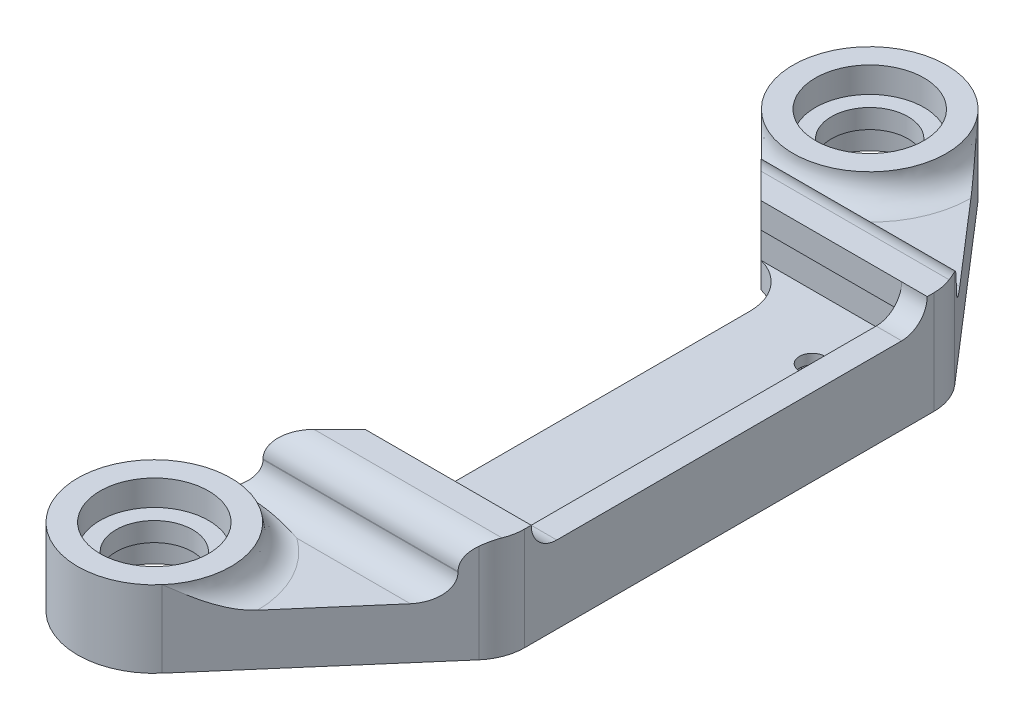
ISO-10303-21;
HEADER;
FILE_DESCRIPTION(('STEP AP214'),'2;1');
FILE_NAME('part.step','',(''),(''),'','','');
FILE_SCHEMA(('AUTOMOTIVE_DESIGN { 1 0 10303 214 1 1 1 1 }'));
ENDSEC;
DATA;
#1=APPLICATION_CONTEXT('core data for automotive mechanical design processes');
#2=APPLICATION_PROTOCOL_DEFINITION('international standard','automotive_design',2000,#1);
#3=PRODUCT_CONTEXT('',#1,'mechanical');
#4=PRODUCT('Part','Part','',(#3));
#5=PRODUCT_RELATED_PRODUCT_CATEGORY('part','',(#4));
#6=PRODUCT_DEFINITION_FORMATION('','',#4);
#7=PRODUCT_DEFINITION_CONTEXT('part definition',#1,'design');
#8=PRODUCT_DEFINITION('design','',#6,#7);
#9=PRODUCT_DEFINITION_SHAPE('','',#8);
#10=(LENGTH_UNIT() NAMED_UNIT(*) SI_UNIT(.MILLI.,.METRE.));
#11=(NAMED_UNIT(*) PLANE_ANGLE_UNIT() SI_UNIT($,.RADIAN.));
#12=(NAMED_UNIT(*) SI_UNIT($,.STERADIAN.) SOLID_ANGLE_UNIT());
#13=UNCERTAINTY_MEASURE_WITH_UNIT(LENGTH_MEASURE(1.E-05),#10,'distance_accuracy_value','');
#14=(GEOMETRIC_REPRESENTATION_CONTEXT(3) GLOBAL_UNCERTAINTY_ASSIGNED_CONTEXT((#13)) GLOBAL_UNIT_ASSIGNED_CONTEXT((#10,
#11,#12)) REPRESENTATION_CONTEXT('',''));
#15=CARTESIAN_POINT('',(0.,0.,0.));
#16=DIRECTION('',(0.,0.,1.));
#17=DIRECTION('',(1.,0.,0.));
#18=AXIS2_PLACEMENT_3D('',#15,#16,#17);
#19=CARTESIAN_POINT('',(-10.,4.,28.));
#20=DIRECTION('',(0.,1.,0.));
#21=DIRECTION('',(0.,0.,-1.));
#22=AXIS2_PLACEMENT_3D('',#19,#20,#21);
#23=PLANE('',#22);
#24=CARTESIAN_POINT('',(-10.,4.,28.));
#25=DIRECTION('',(0.,-1.,0.));
#26=DIRECTION('',(0.,0.,-1.));
#27=AXIS2_PLACEMENT_3D('',#24,#25,#26);
#28=CIRCLE('',#27,3.);
#29=CARTESIAN_POINT('',(-10.,4.,25.));
#30=VERTEX_POINT('',#29);
#31=EDGE_CURVE('E484',#30,#30,#28,.T.);
#32=ORIENTED_EDGE('',*,*,#31,.T.);
#33=EDGE_LOOP('',(#32));
#34=FACE_BOUND('',#33,.T.);
#35=CARTESIAN_POINT('',(-10.,4.,28.));
#36=DIRECTION('',(0.,1.,0.));
#37=DIRECTION('',(0.,0.,1.));
#38=AXIS2_PLACEMENT_3D('',#35,#36,#37);
#39=CIRCLE('',#38,4.25);
#40=CARTESIAN_POINT('',(-10.,4.,32.25));
#41=VERTEX_POINT('',#40);
#42=EDGE_CURVE('E881',#41,#41,#39,.F.);
#43=ORIENTED_EDGE('',*,*,#42,.F.);
#44=EDGE_LOOP('',(#43));
#45=FACE_BOUND('',#44,.T.);
#46=ADVANCED_FACE('F36',(#34,#45),#23,.T.);
#47=CARTESIAN_POINT('',(-10.,4.,-28.));
#48=DIRECTION('',(0.,1.,0.));
#49=DIRECTION('',(0.,0.,1.));
#50=AXIS2_PLACEMENT_3D('',#47,#48,#49);
#51=PLANE('',#50);
#52=CARTESIAN_POINT('',(-10.,4.,-28.));
#53=DIRECTION('',(0.,1.,0.));
#54=DIRECTION('',(0.,0.,1.));
#55=AXIS2_PLACEMENT_3D('',#52,#53,#54);
#56=CIRCLE('',#55,3.);
#57=CARTESIAN_POINT('',(-10.,4.,-25.));
#58=VERTEX_POINT('',#57);
#59=EDGE_CURVE('E548',#58,#58,#56,.T.);
#60=ORIENTED_EDGE('',*,*,#59,.F.);
#61=EDGE_LOOP('',(#60));
#62=FACE_BOUND('',#61,.T.);
#63=CARTESIAN_POINT('',(-10.,4.,-28.));
#64=DIRECTION('',(0.,1.,0.));
#65=DIRECTION('',(0.,0.,1.));
#66=AXIS2_PLACEMENT_3D('',#63,#64,#65);
#67=CIRCLE('',#66,4.25);
#68=CARTESIAN_POINT('',(-10.,4.,-23.75));
#69=VERTEX_POINT('',#68);
#70=EDGE_CURVE('E883',#69,#69,#67,.F.);
#71=ORIENTED_EDGE('',*,*,#70,.F.);
#72=EDGE_LOOP('',(#71));
#73=FACE_BOUND('',#72,.T.);
#74=ADVANCED_FACE('F785',(#62,#73),#51,.T.);
#75=CARTESIAN_POINT('',(1.00000000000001,2.,-12.5));
#76=DIRECTION('',(0.,-1.,0.));
#77=DIRECTION('',(0.,0.,-1.));
#78=AXIS2_PLACEMENT_3D('',#75,#76,#77);
#79=CYLINDRICAL_SURFACE('',#78,1.);
#80=CARTESIAN_POINT('',(1.00000000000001,2.,-12.5));
#81=DIRECTION('',(0.,1.,0.));
#82=DIRECTION('',(0.,0.,1.));
#83=AXIS2_PLACEMENT_3D('',#80,#81,#82);
#84=CIRCLE('',#83,1.);
#85=CARTESIAN_POINT('',(1.00000000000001,2.,-11.5));
#86=VERTEX_POINT('',#85);
#87=EDGE_CURVE('E566',#86,#86,#84,.T.);
#88=ORIENTED_EDGE('',*,*,#87,.T.);
#89=EDGE_LOOP('',(#88));
#90=FACE_BOUND('',#89,.T.);
#91=CARTESIAN_POINT('',(1.00000000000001,1.2,-12.5));
#92=DIRECTION('',(0.,-1.,0.));
#93=DIRECTION('',(0.,0.,-1.));
#94=AXIS2_PLACEMENT_3D('',#91,#92,#93);
#95=CIRCLE('',#94,1.);
#96=CARTESIAN_POINT('',(1.00000000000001,1.2,-13.5));
#97=VERTEX_POINT('',#96);
#98=EDGE_CURVE('E456',#97,#97,#95,.T.);
#99=ORIENTED_EDGE('',*,*,#98,.T.);
#100=EDGE_LOOP('',(#99));
#101=FACE_BOUND('',#100,.T.);
#102=ADVANCED_FACE('F781',(#90,#101),#79,.F.);
#103=CARTESIAN_POINT('',(1.00000000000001,2.,12.5));
#104=DIRECTION('',(0.,-1.,0.));
#105=DIRECTION('',(0.,0.,-1.));
#106=AXIS2_PLACEMENT_3D('',#103,#104,#105);
#107=CYLINDRICAL_SURFACE('',#106,1.);
#108=CARTESIAN_POINT('',(1.00000000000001,2.,12.5));
#109=DIRECTION('',(0.,1.,0.));
#110=DIRECTION('',(0.,0.,1.));
#111=AXIS2_PLACEMENT_3D('',#108,#109,#110);
#112=CIRCLE('',#111,1.);
#113=CARTESIAN_POINT('',(1.00000000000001,2.,13.5));
#114=VERTEX_POINT('',#113);
#115=EDGE_CURVE('E563',#114,#114,#112,.T.);
#116=ORIENTED_EDGE('',*,*,#115,.T.);
#117=EDGE_LOOP('',(#116));
#118=FACE_BOUND('',#117,.T.);
#119=CARTESIAN_POINT('',(1.00000000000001,1.2,12.5));
#120=DIRECTION('',(0.,-1.,0.));
#121=DIRECTION('',(0.,0.,-1.));
#122=AXIS2_PLACEMENT_3D('',#119,#120,#121);
#123=CIRCLE('',#122,1.);
#124=CARTESIAN_POINT('',(1.00000000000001,1.2,11.5));
#125=VERTEX_POINT('',#124);
#126=EDGE_CURVE('E387',#125,#125,#123,.T.);
#127=ORIENTED_EDGE('',*,*,#126,.T.);
#128=EDGE_LOOP('',(#127));
#129=FACE_BOUND('',#128,.T.);
#130=ADVANCED_FACE('F777',(#118,#129),#107,.F.);
#131=DIRECTION('',(-1.,0.,0.));
#132=VECTOR('',#131,1.);
#133=CARTESIAN_POINT('',(-9.99529745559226,4.,21.5));
#134=LINE('',#133,#132);
#135=CARTESIAN_POINT('',(3.54436155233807,4.,21.5));
#136=VERTEX_POINT('',#135);
#137=CARTESIAN_POINT('',(-5.3363104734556,4.,21.5));
#138=VERTEX_POINT('',#137);
#139=EDGE_CURVE('E613',#136,#138,#134,.T.);
#140=ORIENTED_EDGE('',*,*,#139,.T.);
#141=CARTESIAN_POINT('',(-10.,4.,28.));
#142=DIRECTION('',(0.,1.,0.));
#143=DIRECTION('',(0.,0.,1.));
#144=AXIS2_PLACEMENT_3D('',#141,#142,#143);
#145=CIRCLE('',#144,8.);
#146=CARTESIAN_POINT('',(-2.00041780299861,4.,27.9182401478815));
#147=VERTEX_POINT('',#146);
#148=EDGE_CURVE('E57',#138,#147,#145,.F.);
#149=ORIENTED_EDGE('',*,*,#148,.T.);
#150=DIRECTION('',(-0.653738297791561,0.,0.756720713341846));
#151=VECTOR('',#150,1.);
#152=CARTESIAN_POINT('',(7.,4.,17.5));
#153=LINE('',#152,#151);
#154=EDGE_CURVE('E487',#136,#147,#153,.T.);
#155=ORIENTED_EDGE('',*,*,#154,.F.);
#156=EDGE_LOOP('',(#140,#149,#155));
#157=FACE_BOUND('',#156,.T.);
#158=ADVANCED_FACE('F780',(#157),#23,.T.);
#159=CARTESIAN_POINT('',(0.,6.05,0.));
#160=DIRECTION('',(0.,-1.,0.));
#161=DIRECTION('',(0.,0.,-1.));
#162=AXIS2_PLACEMENT_3D('',#159,#160,#161);
#163=PLANE('',#162);
#164=DIRECTION('',(0.,0.,-1.));
#165=VECTOR('',#164,1.);
#166=CARTESIAN_POINT('',(5.,6.05,-17.5));
#167=LINE('',#166,#165);
#168=CARTESIAN_POINT('',(5.,6.05,13.5));
#169=VERTEX_POINT('',#168);
#170=CARTESIAN_POINT('',(5.,6.05,-13.5));
#171=VERTEX_POINT('',#170);
#172=EDGE_CURVE('E521',#169,#171,#167,.T.);
#173=ORIENTED_EDGE('',*,*,#172,.F.);
#174=DIRECTION('',(1.,0.,0.));
#175=VECTOR('',#174,1.);
#176=CARTESIAN_POINT('',(0.,6.05,13.5));
#177=LINE('',#176,#175);
#178=CARTESIAN_POINT('',(7.,6.05,13.5));
#179=VERTEX_POINT('',#178);
#180=EDGE_CURVE('E644',#169,#179,#177,.T.);
#181=ORIENTED_EDGE('',*,*,#180,.T.);
#182=DIRECTION('',(0.,0.,1.));
#183=VECTOR('',#182,1.);
#184=CARTESIAN_POINT('',(7.,6.05,0.));
#185=LINE('',#184,#183);
#186=CARTESIAN_POINT('',(7.,6.05,-13.5));
#187=VERTEX_POINT('',#186);
#188=EDGE_CURVE('E518',#187,#179,#185,.T.);
#189=ORIENTED_EDGE('',*,*,#188,.F.);
#190=DIRECTION('',(1.,0.,0.));
#191=VECTOR('',#190,1.);
#192=CARTESIAN_POINT('',(5.,6.05,-13.5));
#193=LINE('',#192,#191);
#194=EDGE_CURVE('E638',#187,#171,#193,.F.);
#195=ORIENTED_EDGE('',*,*,#194,.T.);
#196=EDGE_LOOP('',(#173,#181,#189,#195));
#197=FACE_BOUND('',#196,.T.);
#198=ADVANCED_FACE('F827',(#197),#163,.F.);
#199=CARTESIAN_POINT('',(7.,4.,-17.5));
#200=DIRECTION('',(0.,0.,-1.));
#201=DIRECTION('',(-1.,0.,0.));
#202=AXIS2_PLACEMENT_3D('',#199,#200,#201);
#203=PLANE('',#202);
#204=DIRECTION('',(-1.,0.,0.));
#205=VECTOR('',#204,1.);
#206=CARTESIAN_POINT('',(5.,2.,-17.5));
#207=LINE('',#206,#205);
#208=CARTESIAN_POINT('',(3.,2.,-17.5));
#209=VERTEX_POINT('',#208);
#210=CARTESIAN_POINT('',(-8.,2.,-17.5));
#211=VERTEX_POINT('',#210);
#212=EDGE_CURVE('E579',#209,#211,#207,.T.);
#213=ORIENTED_EDGE('',*,*,#212,.F.);
#214=DIRECTION('',(0.,-1.,0.));
#215=VECTOR('',#214,1.);
#216=CARTESIAN_POINT('',(3.,6.05,-17.5));
#217=LINE('',#216,#215);
#218=CARTESIAN_POINT('',(3.,6.05,-17.5));
#219=VERTEX_POINT('',#218);
#220=EDGE_CURVE('E675',#209,#219,#217,.F.);
#221=ORIENTED_EDGE('',*,*,#220,.T.);
#222=DIRECTION('',(1.,0.,0.));
#223=VECTOR('',#222,1.);
#224=CARTESIAN_POINT('',(7.,6.05,-17.5));
#225=LINE('',#224,#223);
#226=CARTESIAN_POINT('',(-8.,6.05,-17.5));
#227=VERTEX_POINT('',#226);
#228=EDGE_CURVE('E524',#227,#219,#225,.T.);
#229=ORIENTED_EDGE('',*,*,#228,.F.);
#230=DIRECTION('',(0.,-1.,0.));
#231=VECTOR('',#230,1.);
#232=CARTESIAN_POINT('',(-8.,4.,-17.5));
#233=LINE('',#232,#231);
#234=EDGE_CURVE('E555',#227,#211,#233,.T.);
#235=ORIENTED_EDGE('',*,*,#234,.T.);
#236=EDGE_LOOP('',(#213,#221,#229,#235));
#237=FACE_BOUND('',#236,.T.);
#238=ADVANCED_FACE('F791',(#237),#203,.F.);
#239=CARTESIAN_POINT('',(0.,2.,0.));
#240=DIRECTION('',(0.,1.,0.));
#241=DIRECTION('',(0.,0.,1.));
#242=AXIS2_PLACEMENT_3D('',#239,#240,#241);
#243=PLANE('',#242);
#244=ORIENTED_EDGE('',*,*,#87,.F.);
#245=EDGE_LOOP('',(#244));
#246=FACE_BOUND('',#245,.T.);
#247=DIRECTION('',(1.,0.,0.));
#248=VECTOR('',#247,1.);
#249=CARTESIAN_POINT('',(5.,2.,17.5));
#250=LINE('',#249,#248);
#251=CARTESIAN_POINT('',(-8.,2.,17.5));
#252=VERTEX_POINT('',#251);
#253=CARTESIAN_POINT('',(3.,2.,17.5));
#254=VERTEX_POINT('',#253);
#255=EDGE_CURVE('E573',#252,#254,#250,.T.);
#256=ORIENTED_EDGE('',*,*,#255,.T.);
#257=CARTESIAN_POINT('',(3.,2.,15.5));
#258=DIRECTION('',(0.,1.,0.));
#259=DIRECTION('',(0.,0.,1.));
#260=AXIS2_PLACEMENT_3D('',#257,#258,#259);
#261=CIRCLE('',#260,2.);
#262=CARTESIAN_POINT('',(5.,2.,15.5));
#263=VERTEX_POINT('',#262);
#264=EDGE_CURVE('E666',#254,#263,#261,.T.);
#265=ORIENTED_EDGE('',*,*,#264,.T.);
#266=DIRECTION('',(0.,0.,-1.));
#267=VECTOR('',#266,1.);
#268=CARTESIAN_POINT('',(5.,2.,17.5));
#269=LINE('',#268,#267);
#270=CARTESIAN_POINT('',(5.,2.,-15.5));
#271=VERTEX_POINT('',#270);
#272=EDGE_CURVE('E576',#263,#271,#269,.T.);
#273=ORIENTED_EDGE('',*,*,#272,.T.);
#274=CARTESIAN_POINT('',(3.,2.,-15.5));
#275=DIRECTION('',(0.,1.,0.));
#276=DIRECTION('',(0.,0.,1.));
#277=AXIS2_PLACEMENT_3D('',#274,#275,#276);
#278=CIRCLE('',#277,2.);
#279=EDGE_CURVE('E664',#271,#209,#278,.T.);
#280=ORIENTED_EDGE('',*,*,#279,.T.);
#281=ORIENTED_EDGE('',*,*,#212,.T.);
#282=CARTESIAN_POINT('',(-9.,2.,-13.6270166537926));
#283=DIRECTION('',(0.,1.,0.));
#284=DIRECTION('',(0.,0.,1.));
#285=AXIS2_PLACEMENT_3D('',#282,#283,#284);
#286=CIRCLE('',#285,4.);
#287=CARTESIAN_POINT('',(-5.,2.,-13.6270166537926));
#288=VERTEX_POINT('',#287);
#289=EDGE_CURVE('E588',#211,#288,#286,.F.);
#290=ORIENTED_EDGE('',*,*,#289,.T.);
#291=DIRECTION('',(0.,0.,1.));
#292=VECTOR('',#291,1.);
#293=CARTESIAN_POINT('',(-5.,2.,17.5));
#294=LINE('',#293,#292);
#295=CARTESIAN_POINT('',(-5.,2.,13.6270166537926));
#296=VERTEX_POINT('',#295);
#297=EDGE_CURVE('E570',#288,#296,#294,.T.);
#298=ORIENTED_EDGE('',*,*,#297,.T.);
#299=CARTESIAN_POINT('',(-9.,2.,13.6270166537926));
#300=DIRECTION('',(0.,1.,0.));
#301=DIRECTION('',(0.,0.,1.));
#302=AXIS2_PLACEMENT_3D('',#299,#300,#301);
#303=CIRCLE('',#302,4.);
#304=EDGE_CURVE('E596',#296,#252,#303,.F.);
#305=ORIENTED_EDGE('',*,*,#304,.T.);
#306=EDGE_LOOP('',(#256,#265,#273,#280,#281,#290,#298,#305));
#307=FACE_BOUND('',#306,.T.);
#308=ORIENTED_EDGE('',*,*,#115,.F.);
#309=EDGE_LOOP('',(#308));
#310=FACE_BOUND('',#309,.T.);
#311=ADVANCED_FACE('F787',(#246,#307,#310),#243,.T.);
#312=CARTESIAN_POINT('',(0.,0.,0.));
#313=DIRECTION('',(0.,1.,0.));
#314=DIRECTION('',(0.,0.,1.));
#315=AXIS2_PLACEMENT_3D('',#312,#313,#314);
#316=PLANE('',#315);
#317=DIRECTION('',(-0.866025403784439,0.,-0.5));
#318=VECTOR('',#317,1.);
#319=CARTESIAN_POINT('',(1.00000000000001,0.,14.8094010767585));
#320=LINE('',#319,#318);
#321=CARTESIAN_POINT('',(1.00000000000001,0.,14.8094010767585));
#322=VERTEX_POINT('',#321);
#323=CARTESIAN_POINT('',(-0.999999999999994,0.,13.6547005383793));
#324=VERTEX_POINT('',#323);
#325=EDGE_CURVE('E374',#322,#324,#320,.T.);
#326=ORIENTED_EDGE('',*,*,#325,.F.);
#327=DIRECTION('',(-0.866025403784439,0.,0.5));
#328=VECTOR('',#327,1.);
#329=CARTESIAN_POINT('',(3.00000000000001,0.,13.6547005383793));
#330=LINE('',#329,#328);
#331=CARTESIAN_POINT('',(3.00000000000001,0.,13.6547005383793));
#332=VERTEX_POINT('',#331);
#333=EDGE_CURVE('E339',#332,#322,#330,.T.);
#334=ORIENTED_EDGE('',*,*,#333,.F.);
#335=DIRECTION('',(0.,0.,1.));
#336=VECTOR('',#335,1.);
#337=CARTESIAN_POINT('',(3.00000000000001,0.,11.3452994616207));
#338=LINE('',#337,#336);
#339=CARTESIAN_POINT('',(3.00000000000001,0.,11.3452994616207));
#340=VERTEX_POINT('',#339);
#341=EDGE_CURVE('E357',#340,#332,#338,.T.);
#342=ORIENTED_EDGE('',*,*,#341,.F.);
#343=DIRECTION('',(0.866025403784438,0.,0.5));
#344=VECTOR('',#343,1.);
#345=CARTESIAN_POINT('',(1.00000000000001,0.,10.1905989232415));
#346=LINE('',#345,#344);
#347=CARTESIAN_POINT('',(1.00000000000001,0.,10.1905989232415));
#348=VERTEX_POINT('',#347);
#349=EDGE_CURVE('E360',#348,#340,#346,.T.);
#350=ORIENTED_EDGE('',*,*,#349,.F.);
#351=DIRECTION('',(0.866025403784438,0.,-0.5));
#352=VECTOR('',#351,1.);
#353=CARTESIAN_POINT('',(-0.999999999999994,0.,11.3452994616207));
#354=LINE('',#353,#352);
#355=CARTESIAN_POINT('',(-0.999999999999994,0.,11.3452994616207));
#356=VERTEX_POINT('',#355);
#357=EDGE_CURVE('E380',#356,#348,#354,.T.);
#358=ORIENTED_EDGE('',*,*,#357,.F.);
#359=DIRECTION('',(0.,0.,-1.));
#360=VECTOR('',#359,1.);
#361=CARTESIAN_POINT('',(-0.999999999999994,0.,13.6547005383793));
#362=LINE('',#361,#360);
#363=EDGE_CURVE('E377',#324,#356,#362,.T.);
#364=ORIENTED_EDGE('',*,*,#363,.F.);
#365=EDGE_LOOP('',(#326,#334,#342,#350,#358,#364));
#366=FACE_BOUND('',#365,.T.);
#367=DIRECTION('',(-0.866025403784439,0.,-0.5));
#368=VECTOR('',#367,1.);
#369=CARTESIAN_POINT('',(1.00000000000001,0.,-10.1905989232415));
#370=LINE('',#369,#368);
#371=CARTESIAN_POINT('',(1.00000000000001,0.,-10.1905989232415));
#372=VERTEX_POINT('',#371);
#373=CARTESIAN_POINT('',(-0.999999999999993,0.,-11.3452994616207));
#374=VERTEX_POINT('',#373);
#375=EDGE_CURVE('E417',#372,#374,#370,.T.);
#376=ORIENTED_EDGE('',*,*,#375,.F.);
#377=DIRECTION('',(-0.866025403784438,0.,0.5));
#378=VECTOR('',#377,1.);
#379=CARTESIAN_POINT('',(3.00000000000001,0.,-11.3452994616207));
#380=LINE('',#379,#378);
#381=CARTESIAN_POINT('',(3.00000000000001,0.,-11.3452994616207));
#382=VERTEX_POINT('',#381);
#383=EDGE_CURVE('E415',#382,#372,#380,.T.);
#384=ORIENTED_EDGE('',*,*,#383,.F.);
#385=DIRECTION('',(0.,0.,1.));
#386=VECTOR('',#385,1.);
#387=CARTESIAN_POINT('',(3.00000000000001,0.,-13.6547005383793));
#388=LINE('',#387,#386);
#389=CARTESIAN_POINT('',(3.00000000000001,0.,-13.6547005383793));
#390=VERTEX_POINT('',#389);
#391=EDGE_CURVE('E399',#390,#382,#388,.T.);
#392=ORIENTED_EDGE('',*,*,#391,.F.);
#393=DIRECTION('',(0.866025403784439,0.,0.499999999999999));
#394=VECTOR('',#393,1.);
#395=CARTESIAN_POINT('',(1.,0.,-14.8094010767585));
#396=LINE('',#395,#394);
#397=CARTESIAN_POINT('',(1.,0.,-14.8094010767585));
#398=VERTEX_POINT('',#397);
#399=EDGE_CURVE('E426',#398,#390,#396,.T.);
#400=ORIENTED_EDGE('',*,*,#399,.F.);
#401=DIRECTION('',(0.866025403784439,0.,-0.5));
#402=VECTOR('',#401,1.);
#403=CARTESIAN_POINT('',(-0.999999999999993,0.,-13.6547005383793));
#404=LINE('',#403,#402);
#405=CARTESIAN_POINT('',(-0.999999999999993,0.,-13.6547005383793));
#406=VERTEX_POINT('',#405);
#407=EDGE_CURVE('E423',#406,#398,#404,.T.);
#408=ORIENTED_EDGE('',*,*,#407,.F.);
#409=DIRECTION('',(0.,0.,-1.));
#410=VECTOR('',#409,1.);
#411=CARTESIAN_POINT('',(-0.999999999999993,0.,-11.3452994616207));
#412=LINE('',#411,#410);
#413=EDGE_CURVE('E420',#374,#406,#412,.T.);
#414=ORIENTED_EDGE('',*,*,#413,.F.);
#415=EDGE_LOOP('',(#376,#384,#392,#400,#408,#414));
#416=FACE_BOUND('',#415,.T.);
#417=CARTESIAN_POINT('',(-10.,0.,28.));
#418=DIRECTION('',(0.,1.,0.));
#419=DIRECTION('',(0.,0.,1.));
#420=AXIS2_PLACEMENT_3D('',#417,#418,#419);
#421=CIRCLE('',#420,4.5);
#422=CARTESIAN_POINT('',(-10.,0.,32.5));
#423=VERTEX_POINT('',#422);
#424=EDGE_CURVE('E469',#423,#423,#421,.T.);
#425=ORIENTED_EDGE('',*,*,#424,.T.);
#426=EDGE_LOOP('',(#425));
#427=FACE_BOUND('',#426,.T.);
#428=CARTESIAN_POINT('',(-10.,0.,-28.));
#429=DIRECTION('',(0.,-1.,0.));
#430=DIRECTION('',(0.,0.,-1.));
#431=AXIS2_PLACEMENT_3D('',#428,#429,#430);
#432=CIRCLE('',#431,4.5);
#433=CARTESIAN_POINT('',(-10.,0.,-32.5));
#434=VERTEX_POINT('',#433);
#435=EDGE_CURVE('E533',#434,#434,#432,.T.);
#436=ORIENTED_EDGE('',*,*,#435,.F.);
#437=EDGE_LOOP('',(#436));
#438=FACE_BOUND('',#437,.T.);
#439=DIRECTION('',(-0.653738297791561,0.,-0.756720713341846));
#440=VECTOR('',#439,1.);
#441=CARTESIAN_POINT('',(7.,0.,-17.5));
#442=LINE('',#441,#440);
#443=CARTESIAN_POINT('',(6.02688285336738,0.,-18.6264108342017));
#444=VERTEX_POINT('',#443);
#445=CARTESIAN_POINT('',(-5.45967571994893,0.,-31.9224297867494));
#446=VERTEX_POINT('',#445);
#447=EDGE_CURVE('E540',#444,#446,#442,.T.);
#448=ORIENTED_EDGE('',*,*,#447,.F.);
#449=CARTESIAN_POINT('',(3.,0.,-16.0114576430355));
#450=DIRECTION('',(0.,1.,0.));
#451=DIRECTION('',(0.,0.,1.));
#452=AXIS2_PLACEMENT_3D('',#449,#450,#451);
#453=CIRCLE('',#452,4.);
#454=CARTESIAN_POINT('',(7.,0.,-16.0114576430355));
#455=VERTEX_POINT('',#454);
#456=EDGE_CURVE('E684',#444,#455,#453,.F.);
#457=ORIENTED_EDGE('',*,*,#456,.T.);
#458=DIRECTION('',(0.,0.,1.));
#459=VECTOR('',#458,1.);
#460=CARTESIAN_POINT('',(7.,0.,0.));
#461=LINE('',#460,#459);
#462=CARTESIAN_POINT('',(7.,0.,16.0114576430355));
#463=VERTEX_POINT('',#462);
#464=EDGE_CURVE('E515',#455,#463,#461,.T.);
#465=ORIENTED_EDGE('',*,*,#464,.T.);
#466=CARTESIAN_POINT('',(3.,0.,16.0114576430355));
#467=DIRECTION('',(0.,1.,0.));
#468=DIRECTION('',(0.,0.,1.));
#469=AXIS2_PLACEMENT_3D('',#466,#467,#468);
#470=CIRCLE('',#469,4.);
#471=CARTESIAN_POINT('',(6.02688285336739,0.,18.6264108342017));
#472=VERTEX_POINT('',#471);
#473=EDGE_CURVE('E682',#463,#472,#470,.F.);
#474=ORIENTED_EDGE('',*,*,#473,.T.);
#475=DIRECTION('',(-0.653738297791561,0.,0.756720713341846));
#476=VECTOR('',#475,1.);
#477=CARTESIAN_POINT('',(7.,0.,17.5));
#478=LINE('',#477,#476);
#479=CARTESIAN_POINT('',(-5.45967571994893,0.,31.9224297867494));
#480=VERTEX_POINT('',#479);
#481=EDGE_CURVE('E476',#472,#480,#478,.T.);
#482=ORIENTED_EDGE('',*,*,#481,.T.);
#483=CARTESIAN_POINT('',(-10.,0.,28.));
#484=DIRECTION('',(0.,-1.,0.));
#485=DIRECTION('',(0.,0.,-1.));
#486=AXIS2_PLACEMENT_3D('',#483,#484,#485);
#487=CIRCLE('',#486,6.);
#488=CARTESIAN_POINT('',(-14.2476314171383,0.,23.7623559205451));
#489=VERTEX_POINT('',#488);
#490=EDGE_CURVE('E481',#480,#489,#487,.T.);
#491=ORIENTED_EDGE('',*,*,#490,.T.);
#492=DIRECTION('',(0.706274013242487,0.,-0.707938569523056));
#493=VECTOR('',#492,1.);
#494=CARTESIAN_POINT('',(-8.,0.,17.5));
#495=LINE('',#494,#493);
#496=CARTESIAN_POINT('',(-8.,0.,17.5));
#497=VERTEX_POINT('',#496);
#498=EDGE_CURVE('E478',#489,#497,#495,.T.);
#499=ORIENTED_EDGE('',*,*,#498,.T.);
#500=CARTESIAN_POINT('',(-9.,0.,13.6270166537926));
#501=DIRECTION('',(0.,1.,0.));
#502=DIRECTION('',(0.,0.,1.));
#503=AXIS2_PLACEMENT_3D('',#500,#501,#502);
#504=CIRCLE('',#503,4.);
#505=CARTESIAN_POINT('',(-5.,0.,13.6270166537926));
#506=VERTEX_POINT('',#505);
#507=EDGE_CURVE('E594',#497,#506,#504,.T.);
#508=ORIENTED_EDGE('',*,*,#507,.T.);
#509=DIRECTION('',(0.,0.,1.));
#510=VECTOR('',#509,1.);
#511=CARTESIAN_POINT('',(-5.,0.,17.5));
#512=LINE('',#511,#510);
#513=CARTESIAN_POINT('',(-5.,0.,-13.6270166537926));
#514=VERTEX_POINT('',#513);
#515=EDGE_CURVE('E569',#514,#506,#512,.T.);
#516=ORIENTED_EDGE('',*,*,#515,.F.);
#517=CARTESIAN_POINT('',(-9.,0.,-13.6270166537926));
#518=DIRECTION('',(0.,1.,0.));
#519=DIRECTION('',(0.,0.,1.));
#520=AXIS2_PLACEMENT_3D('',#517,#518,#519);
#521=CIRCLE('',#520,4.);
#522=CARTESIAN_POINT('',(-8.,0.,-17.5));
#523=VERTEX_POINT('',#522);
#524=EDGE_CURVE('E586',#514,#523,#521,.T.);
#525=ORIENTED_EDGE('',*,*,#524,.T.);
#526=DIRECTION('',(0.706274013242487,0.,0.707938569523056));
#527=VECTOR('',#526,1.);
#528=CARTESIAN_POINT('',(-8.,0.,-17.5));
#529=LINE('',#528,#527);
#530=CARTESIAN_POINT('',(-14.2476314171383,0.,-23.7623559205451));
#531=VERTEX_POINT('',#530);
#532=EDGE_CURVE('E545',#531,#523,#529,.T.);
#533=ORIENTED_EDGE('',*,*,#532,.F.);
#534=CARTESIAN_POINT('',(-10.,0.,-28.));
#535=DIRECTION('',(0.,1.,0.));
#536=DIRECTION('',(0.,0.,1.));
#537=AXIS2_PLACEMENT_3D('',#534,#535,#536);
#538=CIRCLE('',#537,6.);
#539=EDGE_CURVE('E542',#446,#531,#538,.T.);
#540=ORIENTED_EDGE('',*,*,#539,.F.);
#541=EDGE_LOOP('',(#448,#457,#465,#474,#482,#491,#499,#508,#516,#525,#533,#540));
#542=FACE_BOUND('',#541,.T.);
#543=ADVANCED_FACE('F790',(#366,#416,#427,#438,#542),#316,.F.);
#544=CARTESIAN_POINT('',(-5.,2.,17.5));
#545=DIRECTION('',(1.,0.,0.));
#546=DIRECTION('',(0.,0.,-1.));
#547=AXIS2_PLACEMENT_3D('',#544,#545,#546);
#548=PLANE('',#547);
#549=ORIENTED_EDGE('',*,*,#515,.T.);
#550=DIRECTION('',(0.,1.,0.));
#551=VECTOR('',#550,1.);
#552=CARTESIAN_POINT('',(-5.,2.,13.6270166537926));
#553=LINE('',#552,#551);
#554=EDGE_CURVE('E590',#506,#296,#553,.T.);
#555=ORIENTED_EDGE('',*,*,#554,.T.);
#556=ORIENTED_EDGE('',*,*,#297,.F.);
#557=DIRECTION('',(0.,-1.,0.));
#558=VECTOR('',#557,1.);
#559=CARTESIAN_POINT('',(-5.,2.,-13.6270166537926));
#560=LINE('',#559,#558);
#561=EDGE_CURVE('E581',#288,#514,#560,.T.);
#562=ORIENTED_EDGE('',*,*,#561,.T.);
#563=EDGE_LOOP('',(#549,#555,#556,#562));
#564=FACE_BOUND('',#563,.T.);
#565=ADVANCED_FACE('F795',(#564),#548,.F.);
#566=DIRECTION('',(-0.653738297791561,0.,-0.756720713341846));
#567=VECTOR('',#566,1.);
#568=CARTESIAN_POINT('',(7.,4.,-17.5));
#569=LINE('',#568,#567);
#570=CARTESIAN_POINT('',(3.54436155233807,4.,-21.5));
#571=VERTEX_POINT('',#570);
#572=CARTESIAN_POINT('',(-2.00041780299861,4.,-27.9182401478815));
#573=VERTEX_POINT('',#572);
#574=EDGE_CURVE('E551',#571,#573,#569,.T.);
#575=ORIENTED_EDGE('',*,*,#574,.T.);
#576=CARTESIAN_POINT('',(-10.,4.,-28.));
#577=DIRECTION('',(0.,1.,0.));
#578=DIRECTION('',(0.,0.,1.));
#579=AXIS2_PLACEMENT_3D('',#576,#577,#578);
#580=CIRCLE('',#579,8.);
#581=CARTESIAN_POINT('',(-5.3363104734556,4.,-21.5));
#582=VERTEX_POINT('',#581);
#583=EDGE_CURVE('E873',#573,#582,#580,.F.);
#584=ORIENTED_EDGE('',*,*,#583,.T.);
#585=DIRECTION('',(-1.,0.,0.));
#586=VECTOR('',#585,1.);
#587=CARTESIAN_POINT('',(-10.,4.,-21.5));
#588=LINE('',#587,#586);
#589=EDGE_CURVE('E627',#582,#571,#588,.F.);
#590=ORIENTED_EDGE('',*,*,#589,.T.);
#591=EDGE_LOOP('',(#575,#584,#590));
#592=FACE_BOUND('',#591,.T.);
#593=ADVANCED_FACE('F775',(#592),#51,.T.);
#594=CARTESIAN_POINT('',(7.,4.,-17.5));
#595=DIRECTION('',(-0.756720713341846,0.,0.653738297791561));
#596=DIRECTION('',(0.653738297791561,0.,0.756720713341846));
#597=AXIS2_PLACEMENT_3D('',#594,#595,#596);
#598=PLANE('',#597);
#599=CARTESIAN_POINT('',(6.99999999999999,6.05,-17.5));
#600=DIRECTION('',(-0.756720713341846,0.,0.653738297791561));
#601=DIRECTION('',(0.653738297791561,0.,0.756720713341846));
#602=AXIS2_PLACEMENT_3D('',#599,#600,#601);
#603=ELLIPSE('',#602,2.64298302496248,2.);
#604=CARTESIAN_POINT('',(5.27218077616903,6.05,-19.5));
#605=VERTEX_POINT('',#604);
#606=CARTESIAN_POINT('',(6.02688285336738,7.70263384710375,-18.6264108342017));
#607=VERTEX_POINT('',#606);
#608=EDGE_CURVE('E624',#605,#607,#603,.F.);
#609=ORIENTED_EDGE('',*,*,#608,.T.);
#610=DIRECTION('',(0.,-1.,0.));
#611=VECTOR('',#610,1.);
#612=CARTESIAN_POINT('',(6.02688285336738,4.,-18.6264108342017));
#613=LINE('',#612,#611);
#614=EDGE_CURVE('E679',#607,#444,#613,.T.);
#615=ORIENTED_EDGE('',*,*,#614,.T.);
#616=ORIENTED_EDGE('',*,*,#447,.T.);
#617=DIRECTION('',(0.,-1.,0.));
#618=VECTOR('',#617,1.);
#619=CARTESIAN_POINT('',(-5.45967571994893,4.,-31.9224297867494));
#620=LINE('',#619,#618);
#621=CARTESIAN_POINT('',(-5.45967571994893,6.,-31.9224297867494));
#622=VERTEX_POINT('',#621);
#623=EDGE_CURVE('E560',#622,#446,#620,.T.);
#624=ORIENTED_EDGE('',*,*,#623,.F.);
#625=CARTESIAN_POINT('',(-2.00041780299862,4.,-27.9182401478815));
#626=CARTESIAN_POINT('',(-2.09923791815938,4.00003932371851,-28.0326272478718));
#627=CARTESIAN_POINT('',(-2.1979412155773,4.00749080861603,-28.1468791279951));
#628=CARTESIAN_POINT('',(-2.39437209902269,4.03529748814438,-28.3742534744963));
#629=CARTESIAN_POINT('',(-2.49210131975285,4.05562506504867,-28.4873778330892));
#630=CARTESIAN_POINT('',(-2.68487831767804,4.10690972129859,-28.7105227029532));
#631=CARTESIAN_POINT('',(-2.77994445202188,4.13771036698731,-28.8205644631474));
#632=CARTESIAN_POINT('',(-2.96864573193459,4.20848018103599,-29.0389915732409));
#633=CARTESIAN_POINT('',(-3.06228001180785,4.24845467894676,-29.1473759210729));
#634=CARTESIAN_POINT('',(-3.35781909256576,4.388047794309,-29.4894708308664));
#635=CARTESIAN_POINT('',(-3.55677478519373,4.5022836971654,-29.7197677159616));
#636=CARTESIAN_POINT('',(-3.94771685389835,4.75580816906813,-30.172294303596));
#637=CARTESIAN_POINT('',(-4.13969489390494,4.89512559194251,-30.3945143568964));
#638=CARTESIAN_POINT('',(-4.71021063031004,5.33812108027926,-31.0549025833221));
#639=CARTESIAN_POINT('',(-5.08072691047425,5.66533067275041,-31.4837857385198));
#640=CARTESIAN_POINT('',(-5.45382852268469,5.99483605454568,-31.915661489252));
#641=CARTESIAN_POINT('',(-5.45675212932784,5.99741804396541,-31.9190456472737));
#642=CARTESIAN_POINT('',(-5.45967571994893,6.,-31.9224297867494));
#643=B_SPLINE_CURVE_WITH_KNOTS('',3,(#625,#626,#627,#628,#629,#630,#631,#632,#633,#634,#635,
#636,#637,#638,#639,#640,#641,#642),.UNSPECIFIED.,.F.,.F.,(4,2,2,2,2,2,2,2,4),(0.,
0.453047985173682,0.90512751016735,1.35073120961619,1.79659444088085,2.76988627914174,
3.74430503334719,5.70583133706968,5.72132327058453),.UNSPECIFIED.);
#644=EDGE_CURVE('E756',#622,#573,#643,.F.);
#645=ORIENTED_EDGE('',*,*,#644,.T.);
#646=ORIENTED_EDGE('',*,*,#574,.F.);
#647=CARTESIAN_POINT('',(3.54436155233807,6.,-21.5));
#648=DIRECTION('',(-0.756720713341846,0.,0.653738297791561));
#649=DIRECTION('',(-0.653738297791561,0.,-0.756720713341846));
#650=AXIS2_PLACEMENT_3D('',#647,#648,#649);
#651=ELLIPSE('',#650,2.64298302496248,2.);
#652=CARTESIAN_POINT('',(5.27218077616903,6.,-19.5));
#653=VERTEX_POINT('',#652);
#654=EDGE_CURVE('E636',#571,#653,#651,.T.);
#655=ORIENTED_EDGE('',*,*,#654,.T.);
#656=DIRECTION('',(0.,-1.,0.));
#657=VECTOR('',#656,1.);
#658=CARTESIAN_POINT('',(5.27218077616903,6.05,-19.5));
#659=LINE('',#658,#657);
#660=EDGE_CURVE('E530',#605,#653,#659,.T.);
#661=ORIENTED_EDGE('',*,*,#660,.F.);
#662=EDGE_LOOP('',(#609,#615,#616,#624,#645,#646,#655,#661));
#663=FACE_BOUND('',#662,.T.);
#664=ADVANCED_FACE('F769',(#663),#598,.F.);
#665=CARTESIAN_POINT('',(-10.,4.,-28.));
#666=DIRECTION('',(0.,-1.,0.));
#667=DIRECTION('',(0.,0.,-1.));
#668=AXIS2_PLACEMENT_3D('',#665,#666,#667);
#669=CYLINDRICAL_SURFACE('',#668,6.);
#670=CARTESIAN_POINT('',(-10.,6.,-28.));
#671=DIRECTION('',(0.,1.,0.));
#672=DIRECTION('',(0.,0.,1.));
#673=AXIS2_PLACEMENT_3D('',#670,#671,#672);
#674=CIRCLE('',#673,6.);
#675=CARTESIAN_POINT('',(-14.2476314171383,6.,-23.7623559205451));
#676=VERTEX_POINT('',#675);
#677=EDGE_CURVE('E363',#622,#676,#674,.T.);
#678=ORIENTED_EDGE('',*,*,#677,.F.);
#679=ORIENTED_EDGE('',*,*,#623,.T.);
#680=ORIENTED_EDGE('',*,*,#539,.T.);
#681=DIRECTION('',(0.,-1.,0.));
#682=VECTOR('',#681,1.);
#683=CARTESIAN_POINT('',(-14.2476314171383,4.,-23.7623559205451));
#684=LINE('',#683,#682);
#685=EDGE_CURVE('E558',#676,#531,#684,.T.);
#686=ORIENTED_EDGE('',*,*,#685,.F.);
#687=EDGE_LOOP('',(#678,#679,#680,#686));
#688=FACE_BOUND('',#687,.T.);
#689=ADVANCED_FACE('F774',(#688),#669,.T.);
#690=CARTESIAN_POINT('',(-8.,4.,-17.5));
#691=DIRECTION('',(0.707938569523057,0.,-0.706274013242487));
#692=DIRECTION('',(-0.706274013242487,0.,-0.707938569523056));
#693=AXIS2_PLACEMENT_3D('',#690,#691,#692);
#694=PLANE('',#693);
#695=DIRECTION('',(0.706274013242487,0.,0.707938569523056));
#696=VECTOR('',#695,1.);
#697=CARTESIAN_POINT('',(-9.99529745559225,8.05,-19.5));
#698=LINE('',#697,#696);
#699=CARTESIAN_POINT('',(-8.,8.05,-17.5));
#700=VERTEX_POINT('',#699);
#701=CARTESIAN_POINT('',(-6.00470254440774,8.05,-15.5));
#702=VERTEX_POINT('',#701);
#703=EDGE_CURVE('E499',#700,#702,#698,.T.);
#704=ORIENTED_EDGE('',*,*,#703,.F.);
#705=CARTESIAN_POINT('',(-8.,6.05,-17.5));
#706=DIRECTION('',(0.707938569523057,0.,-0.706274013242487));
#707=DIRECTION('',(0.706274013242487,0.,0.707938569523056));
#708=AXIS2_PLACEMENT_3D('',#705,#706,#707);
#709=ELLIPSE('',#708,2.82510388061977,2.);
#710=CARTESIAN_POINT('',(-9.99529745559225,6.05,-19.5));
#711=VERTEX_POINT('',#710);
#712=EDGE_CURVE('E617',#700,#711,#709,.F.);
#713=ORIENTED_EDGE('',*,*,#712,.T.);
#714=DIRECTION('',(0.,-1.,0.));
#715=VECTOR('',#714,1.);
#716=CARTESIAN_POINT('',(-9.99529745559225,6.05,-19.5));
#717=LINE('',#716,#715);
#718=CARTESIAN_POINT('',(-9.99529745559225,6.,-19.5));
#719=VERTEX_POINT('',#718);
#720=EDGE_CURVE('E527',#711,#719,#717,.T.);
#721=ORIENTED_EDGE('',*,*,#720,.T.);
#722=CARTESIAN_POINT('',(-11.9905949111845,6.,-21.5));
#723=DIRECTION('',(0.707938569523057,0.,-0.706274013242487));
#724=DIRECTION('',(-0.706274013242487,0.,-0.707938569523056));
#725=AXIS2_PLACEMENT_3D('',#722,#723,#724);
#726=ELLIPSE('',#725,2.82510388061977,2.);
#727=CARTESIAN_POINT('',(-11.3005460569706,4.12341121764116,-20.8083248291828));
#728=VERTEX_POINT('',#727);
#729=EDGE_CURVE('E633',#719,#728,#726,.T.);
#730=ORIENTED_EDGE('',*,*,#729,.T.);
#731=CARTESIAN_POINT('',(-11.3005460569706,4.12341121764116,-20.8083248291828));
#732=CARTESIAN_POINT('',(-11.3886136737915,4.14966329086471,-20.8966000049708));
#733=CARTESIAN_POINT('',(-11.4761032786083,4.17952790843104,-20.9842958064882));
#734=CARTESIAN_POINT('',(-11.649817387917,4.2456006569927,-21.1584193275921));
#735=CARTESIAN_POINT('',(-11.7360427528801,4.281804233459,-21.2448479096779));
#736=CARTESIAN_POINT('',(-11.9922455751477,4.39839429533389,-21.5016545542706));
#737=CARTESIAN_POINT('',(-12.1603685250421,4.48695657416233,-21.6701737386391));
#738=CARTESIAN_POINT('',(-12.4905639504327,4.67941998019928,-22.0011473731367));
#739=CARTESIAN_POINT('',(-12.6526725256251,4.78320024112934,-22.1636380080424));
#740=CARTESIAN_POINT('',(-12.9731637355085,5.00205381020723,-22.4848845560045));
#741=CARTESIAN_POINT('',(-13.1315430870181,5.1171366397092,-22.6436371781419));
#742=CARTESIAN_POINT('',(-13.4487159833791,5.35689529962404,-22.9615575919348));
#743=CARTESIAN_POINT('',(-13.607453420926,5.48171782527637,-23.1206691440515));
#744=CARTESIAN_POINT('',(-13.9235181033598,5.73509904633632,-23.4374787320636));
#745=CARTESIAN_POINT('',(-14.0808446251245,5.8636595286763,-23.5951760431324));
#746=CARTESIAN_POINT('',(-14.2413143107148,5.99483602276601,-23.7560239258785));
#747=CARTESIAN_POINT('',(-14.2444728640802,5.99741801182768,-23.7591899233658));
#748=CARTESIAN_POINT('',(-14.2476314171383,6.,-23.7623559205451));
#749=B_SPLINE_CURVE_WITH_KNOTS('',3,(#731,#732,#733,#734,#735,#736,#737,#738,#739,#740,#741,
#742,#743,#744,#745,#746,#747,#748),.UNSPECIFIED.,.F.,.F.,(4,2,2,2,2,2,2,2,4),(0.,
0.382139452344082,0.764005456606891,1.52505523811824,2.2803586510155,3.03630388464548,
3.8075001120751,4.57907127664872,4.59456321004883),.UNSPECIFIED.);
#750=EDGE_CURVE('E763',#728,#676,#749,.T.);
#751=ORIENTED_EDGE('',*,*,#750,.T.);
#752=ORIENTED_EDGE('',*,*,#685,.T.);
#753=ORIENTED_EDGE('',*,*,#532,.T.);
#754=EDGE_CURVE('E554',#211,#523,#233,.T.);
#755=ORIENTED_EDGE('',*,*,#754,.F.);
#756=ORIENTED_EDGE('',*,*,#234,.F.);
#757=DIRECTION('',(0.706274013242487,0.,0.707938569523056));
#758=VECTOR('',#757,1.);
#759=CARTESIAN_POINT('',(-9.99529745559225,6.05,-19.5));
#760=LINE('',#759,#758);
#761=CARTESIAN_POINT('',(-6.00470254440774,6.05,-15.5));
#762=VERTEX_POINT('',#761);
#763=EDGE_CURVE('E498',#227,#762,#760,.T.);
#764=ORIENTED_EDGE('',*,*,#763,.T.);
#765=DIRECTION('',(0.,-1.,0.));
#766=VECTOR('',#765,1.);
#767=CARTESIAN_POINT('',(-6.00470254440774,8.05,-15.5));
#768=LINE('',#767,#766);
#769=EDGE_CURVE('E509',#702,#762,#768,.T.);
#770=ORIENTED_EDGE('',*,*,#769,.F.);
#771=EDGE_LOOP('',(#704,#713,#721,#730,#751,#752,#753,#755,#756,#764,#770));
#772=FACE_BOUND('',#771,.T.);
#773=ADVANCED_FACE('F811',(#772),#694,.F.);
#774=CARTESIAN_POINT('',(-10.,4.,-28.));
#775=DIRECTION('',(0.,-1.,0.));
#776=DIRECTION('',(0.,0.,-1.));
#777=AXIS2_PLACEMENT_3D('',#774,#775,#776);
#778=CYLINDRICAL_SURFACE('',#777,3.);
#779=CARTESIAN_POINT('',(-10.,2.5,-28.));
#780=DIRECTION('',(0.,1.,0.));
#781=DIRECTION('',(0.,0.,1.));
#782=AXIS2_PLACEMENT_3D('',#779,#780,#781);
#783=CIRCLE('',#782,3.);
#784=CARTESIAN_POINT('',(-10.,2.5,-25.));
#785=VERTEX_POINT('',#784);
#786=EDGE_CURVE('E539',#785,#785,#783,.T.);
#787=ORIENTED_EDGE('',*,*,#786,.F.);
#788=EDGE_LOOP('',(#787));
#789=FACE_BOUND('',#788,.T.);
#790=ORIENTED_EDGE('',*,*,#59,.T.);
#791=EDGE_LOOP('',(#790));
#792=FACE_BOUND('',#791,.T.);
#793=ADVANCED_FACE('F802',(#789,#792),#778,.F.);
#794=CARTESIAN_POINT('',(-9.,4.,-13.6270166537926));
#795=DIRECTION('',(0.,-1.,0.));
#796=DIRECTION('',(0.,0.,-1.));
#797=AXIS2_PLACEMENT_3D('',#794,#795,#796);
#798=CYLINDRICAL_SURFACE('',#797,4.);
#799=ORIENTED_EDGE('',*,*,#289,.F.);
#800=ORIENTED_EDGE('',*,*,#754,.T.);
#801=ORIENTED_EDGE('',*,*,#524,.F.);
#802=ORIENTED_EDGE('',*,*,#561,.F.);
#803=EDGE_LOOP('',(#799,#800,#801,#802));
#804=FACE_BOUND('',#803,.T.);
#805=ADVANCED_FACE('F799',(#804),#798,.F.);
#806=CARTESIAN_POINT('',(-10.,2.5,-28.));
#807=DIRECTION('',(0.,1.,0.));
#808=DIRECTION('',(0.,0.,1.));
#809=AXIS2_PLACEMENT_3D('',#806,#807,#808);
#810=PLANE('',#809);
#811=ORIENTED_EDGE('',*,*,#786,.T.);
#812=EDGE_LOOP('',(#811));
#813=FACE_BOUND('',#812,.T.);
#814=CARTESIAN_POINT('',(-10.,2.5,-28.));
#815=DIRECTION('',(0.,1.,0.));
#816=DIRECTION('',(0.,0.,1.));
#817=AXIS2_PLACEMENT_3D('',#814,#815,#816);
#818=CIRCLE('',#817,4.5);
#819=CARTESIAN_POINT('',(-10.,2.5,-23.5));
#820=VERTEX_POINT('',#819);
#821=EDGE_CURVE('E536',#820,#820,#818,.F.);
#822=ORIENTED_EDGE('',*,*,#821,.T.);
#823=EDGE_LOOP('',(#822));
#824=FACE_BOUND('',#823,.T.);
#825=ADVANCED_FACE('F801',(#813,#824),#810,.F.);
#826=CARTESIAN_POINT('',(-10.,16.7279220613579,-28.));
#827=DIRECTION('',(0.,-1.,0.));
#828=DIRECTION('',(0.,0.,-1.));
#829=AXIS2_PLACEMENT_3D('',#826,#827,#828);
#830=CYLINDRICAL_SURFACE('',#829,4.5);
#831=ORIENTED_EDGE('',*,*,#435,.T.);
#832=EDGE_LOOP('',(#831));
#833=FACE_BOUND('',#832,.T.);
#834=ORIENTED_EDGE('',*,*,#821,.F.);
#835=EDGE_LOOP('',(#834));
#836=FACE_BOUND('',#835,.T.);
#837=ADVANCED_FACE('F808',(#833,#836),#830,.F.);
#838=CARTESIAN_POINT('',(-9.99529745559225,6.05,-19.5));
#839=DIRECTION('',(0.,0.,1.));
#840=DIRECTION('',(1.,0.,0.));
#841=AXIS2_PLACEMENT_3D('',#838,#839,#840);
#842=PLANE('',#841);
#843=ORIENTED_EDGE('',*,*,#720,.F.);
#844=DIRECTION('',(-1.,0.,0.));
#845=VECTOR('',#844,1.);
#846=CARTESIAN_POINT('',(5.27218077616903,6.05,-19.5));
#847=LINE('',#846,#845);
#848=EDGE_CURVE('E622',#711,#605,#847,.F.);
#849=ORIENTED_EDGE('',*,*,#848,.T.);
#850=ORIENTED_EDGE('',*,*,#660,.T.);
#851=DIRECTION('',(-1.,0.,0.));
#852=VECTOR('',#851,1.);
#853=CARTESIAN_POINT('',(-9.99529745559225,6.,-19.5));
#854=LINE('',#853,#852);
#855=EDGE_CURVE('E619',#653,#719,#854,.T.);
#856=ORIENTED_EDGE('',*,*,#855,.T.);
#857=EDGE_LOOP('',(#843,#849,#850,#856));
#858=FACE_BOUND('',#857,.T.);
#859=ADVANCED_FACE('F943',(#858),#842,.F.);
#860=CARTESIAN_POINT('',(7.,23.6639149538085,0.));
#861=DIRECTION('',(-1.,0.,0.));
#862=DIRECTION('',(0.,0.,1.));
#863=AXIS2_PLACEMENT_3D('',#860,#861,#862);
#864=PLANE('',#863);
#865=ORIENTED_EDGE('',*,*,#464,.F.);
#866=DIRECTION('',(0.,-1.,0.));
#867=VECTOR('',#866,1.);
#868=CARTESIAN_POINT('',(7.,23.6639149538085,-16.0114576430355));
#869=LINE('',#868,#867);
#870=CARTESIAN_POINT('',(7.,8.05,-16.0114576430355));
#871=VERTEX_POINT('',#870);
#872=EDGE_CURVE('E689',#455,#871,#869,.F.);
#873=ORIENTED_EDGE('',*,*,#872,.T.);
#874=DIRECTION('',(0.,0.,-1.));
#875=VECTOR('',#874,1.);
#876=CARTESIAN_POINT('',(7.,8.05,-17.5));
#877=LINE('',#876,#875);
#878=CARTESIAN_POINT('',(7.,8.05,-15.5));
#879=VERTEX_POINT('',#878);
#880=EDGE_CURVE('E506',#879,#871,#877,.T.);
#881=ORIENTED_EDGE('',*,*,#880,.F.);
#882=CARTESIAN_POINT('',(7.,8.05,-13.5));
#883=DIRECTION('',(-1.,0.,0.));
#884=DIRECTION('',(0.,0.,1.));
#885=AXIS2_PLACEMENT_3D('',#882,#883,#884);
#886=CIRCLE('',#885,2.);
#887=EDGE_CURVE('E657',#879,#187,#886,.T.);
#888=ORIENTED_EDGE('',*,*,#887,.T.);
#889=ORIENTED_EDGE('',*,*,#188,.T.);
#890=CARTESIAN_POINT('',(7.,8.05,13.5));
#891=DIRECTION('',(-1.,0.,0.));
#892=DIRECTION('',(0.,0.,1.));
#893=AXIS2_PLACEMENT_3D('',#890,#891,#892);
#894=CIRCLE('',#893,2.);
#895=CARTESIAN_POINT('',(7.,8.05,15.5));
#896=VERTEX_POINT('',#895);
#897=EDGE_CURVE('E653',#179,#896,#894,.T.);
#898=ORIENTED_EDGE('',*,*,#897,.T.);
#899=DIRECTION('',(0.,0.,1.));
#900=VECTOR('',#899,1.);
#901=CARTESIAN_POINT('',(7.,8.05,17.5));
#902=LINE('',#901,#900);
#903=CARTESIAN_POINT('',(7.,8.05,16.0114576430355));
#904=VERTEX_POINT('',#903);
#905=EDGE_CURVE('E442',#896,#904,#902,.T.);
#906=ORIENTED_EDGE('',*,*,#905,.T.);
#907=DIRECTION('',(0.,-1.,0.));
#908=VECTOR('',#907,1.);
#909=CARTESIAN_POINT('',(7.,0.,16.0114576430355));
#910=LINE('',#909,#908);
#911=EDGE_CURVE('E686',#904,#463,#910,.T.);
#912=ORIENTED_EDGE('',*,*,#911,.T.);
#913=EDGE_LOOP('',(#865,#873,#881,#888,#889,#898,#906,#912));
#914=FACE_BOUND('',#913,.T.);
#915=ADVANCED_FACE('F899',(#914),#864,.F.);
#916=CARTESIAN_POINT('',(5.,23.6639149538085,-17.5));
#917=DIRECTION('',(1.,0.,0.));
#918=DIRECTION('',(0.,0.,-1.));
#919=AXIS2_PLACEMENT_3D('',#916,#917,#918);
#920=PLANE('',#919);
#921=ORIENTED_EDGE('',*,*,#272,.F.);
#922=DIRECTION('',(0.,-1.,0.));
#923=VECTOR('',#922,1.);
#924=CARTESIAN_POINT('',(5.,23.6639149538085,15.5));
#925=LINE('',#924,#923);
#926=CARTESIAN_POINT('',(5.,6.05,15.5));
#927=VERTEX_POINT('',#926);
#928=EDGE_CURVE('E671',#263,#927,#925,.F.);
#929=ORIENTED_EDGE('',*,*,#928,.T.);
#930=DIRECTION('',(0.,-1.,0.));
#931=VECTOR('',#930,1.);
#932=CARTESIAN_POINT('',(5.,8.05,15.5));
#933=LINE('',#932,#931);
#934=CARTESIAN_POINT('',(5.,8.05,15.5));
#935=VERTEX_POINT('',#934);
#936=EDGE_CURVE('E647',#935,#927,#933,.T.);
#937=ORIENTED_EDGE('',*,*,#936,.F.);
#938=CARTESIAN_POINT('',(5.,8.05,13.5));
#939=DIRECTION('',(1.,0.,0.));
#940=DIRECTION('',(0.,0.,-1.));
#941=AXIS2_PLACEMENT_3D('',#938,#939,#940);
#942=CIRCLE('',#941,2.);
#943=EDGE_CURVE('E655',#935,#169,#942,.T.);
#944=ORIENTED_EDGE('',*,*,#943,.T.);
#945=ORIENTED_EDGE('',*,*,#172,.T.);
#946=CARTESIAN_POINT('',(5.,8.05,-13.5));
#947=DIRECTION('',(1.,0.,0.));
#948=DIRECTION('',(0.,0.,-1.));
#949=AXIS2_PLACEMENT_3D('',#946,#947,#948);
#950=CIRCLE('',#949,2.);
#951=CARTESIAN_POINT('',(5.,8.05,-15.5));
#952=VERTEX_POINT('',#951);
#953=EDGE_CURVE('E659',#171,#952,#950,.T.);
#954=ORIENTED_EDGE('',*,*,#953,.T.);
#955=DIRECTION('',(0.,1.,0.));
#956=VECTOR('',#955,1.);
#957=CARTESIAN_POINT('',(5.,23.6639149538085,-15.5));
#958=LINE('',#957,#956);
#959=CARTESIAN_POINT('',(5.,6.05,-15.5));
#960=VERTEX_POINT('',#959);
#961=EDGE_CURVE('E650',#960,#952,#958,.T.);
#962=ORIENTED_EDGE('',*,*,#961,.F.);
#963=DIRECTION('',(0.,-1.,0.));
#964=VECTOR('',#963,1.);
#965=CARTESIAN_POINT('',(5.,2.00000000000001,-15.5));
#966=LINE('',#965,#964);
#967=EDGE_CURVE('E668',#960,#271,#966,.T.);
#968=ORIENTED_EDGE('',*,*,#967,.T.);
#969=EDGE_LOOP('',(#921,#929,#937,#944,#945,#954,#962,#968));
#970=FACE_BOUND('',#969,.T.);
#971=ADVANCED_FACE('F936',(#970),#920,.F.);
#972=CARTESIAN_POINT('',(0.,6.05,0.));
#973=DIRECTION('',(0.,1.,0.));
#974=DIRECTION('',(0.,0.,1.));
#975=AXIS2_PLACEMENT_3D('',#972,#973,#974);
#976=PLANE('',#975);
#977=ORIENTED_EDGE('',*,*,#228,.T.);
#978=CARTESIAN_POINT('',(3.,6.05,-15.5));
#979=DIRECTION('',(0.,1.,0.));
#980=DIRECTION('',(0.,0.,1.));
#981=AXIS2_PLACEMENT_3D('',#978,#979,#980);
#982=CIRCLE('',#981,2.);
#983=EDGE_CURVE('E677',#219,#960,#982,.F.);
#984=ORIENTED_EDGE('',*,*,#983,.T.);
#985=DIRECTION('',(1.,0.,0.));
#986=VECTOR('',#985,1.);
#987=CARTESIAN_POINT('',(-6.00470254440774,6.05,-15.5));
#988=LINE('',#987,#986);
#989=EDGE_CURVE('E502',#762,#960,#988,.T.);
#990=ORIENTED_EDGE('',*,*,#989,.F.);
#991=ORIENTED_EDGE('',*,*,#763,.F.);
#992=EDGE_LOOP('',(#977,#984,#990,#991));
#993=FACE_BOUND('',#992,.T.);
#994=ADVANCED_FACE('F933',(#993),#976,.F.);
#995=CARTESIAN_POINT('',(-6.00470254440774,8.05,-15.5));
#996=DIRECTION('',(0.,0.,-1.));
#997=DIRECTION('',(-1.,0.,0.));
#998=AXIS2_PLACEMENT_3D('',#995,#996,#997);
#999=PLANE('',#998);
#1000=ORIENTED_EDGE('',*,*,#989,.T.);
#1001=ORIENTED_EDGE('',*,*,#961,.T.);
#1002=DIRECTION('',(1.,0.,0.));
#1003=VECTOR('',#1002,1.);
#1004=CARTESIAN_POINT('',(-6.00470254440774,8.05,-15.5));
#1005=LINE('',#1004,#1003);
#1006=EDGE_CURVE('E503',#702,#952,#1005,.T.);
#1007=ORIENTED_EDGE('',*,*,#1006,.F.);
#1008=ORIENTED_EDGE('',*,*,#769,.T.);
#1009=EDGE_LOOP('',(#1000,#1001,#1007,#1008));
#1010=FACE_BOUND('',#1009,.T.);
#1011=ADVANCED_FACE('F931',(#1010),#999,.F.);
#1012=CARTESIAN_POINT('',(0.,8.05,0.));
#1013=DIRECTION('',(0.,1.,0.));
#1014=DIRECTION('',(0.,0.,1.));
#1015=AXIS2_PLACEMENT_3D('',#1012,#1013,#1014);
#1016=PLANE('',#1015);
#1017=ORIENTED_EDGE('',*,*,#880,.T.);
#1018=CARTESIAN_POINT('',(3.,8.05,-16.0114576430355));
#1019=DIRECTION('',(0.,1.,0.));
#1020=DIRECTION('',(0.,0.,1.));
#1021=AXIS2_PLACEMENT_3D('',#1018,#1019,#1020);
#1022=CIRCLE('',#1021,4.);
#1023=CARTESIAN_POINT('',(6.71271351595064,8.05,-17.5));
#1024=VERTEX_POINT('',#1023);
#1025=EDGE_CURVE('E691',#871,#1024,#1022,.T.);
#1026=ORIENTED_EDGE('',*,*,#1025,.T.);
#1027=DIRECTION('',(-1.,0.,0.));
#1028=VECTOR('',#1027,1.);
#1029=CARTESIAN_POINT('',(-9.99529745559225,8.05,-17.5));
#1030=LINE('',#1029,#1028);
#1031=EDGE_CURVE('E615',#1024,#700,#1030,.T.);
#1032=ORIENTED_EDGE('',*,*,#1031,.T.);
#1033=ORIENTED_EDGE('',*,*,#703,.T.);
#1034=ORIENTED_EDGE('',*,*,#1006,.T.);
#1035=EDGE_CURVE('E501',#952,#879,#1005,.T.);
#1036=ORIENTED_EDGE('',*,*,#1035,.T.);
#1037=EDGE_LOOP('',(#1017,#1026,#1032,#1033,#1034,#1036));
#1038=FACE_BOUND('',#1037,.T.);
#1039=ADVANCED_FACE('F924',(#1038),#1016,.T.);
#1040=CARTESIAN_POINT('',(7.,4.,17.5));
#1041=DIRECTION('',(0.,0.,-1.));
#1042=DIRECTION('',(-1.,0.,0.));
#1043=AXIS2_PLACEMENT_3D('',#1040,#1041,#1042);
#1044=PLANE('',#1043);
#1045=DIRECTION('',(1.,0.,0.));
#1046=VECTOR('',#1045,1.);
#1047=CARTESIAN_POINT('',(7.,6.05,17.5));
#1048=LINE('',#1047,#1046);
#1049=CARTESIAN_POINT('',(-8.,6.05,17.5));
#1050=VERTEX_POINT('',#1049);
#1051=CARTESIAN_POINT('',(3.,6.05,17.5));
#1052=VERTEX_POINT('',#1051);
#1053=EDGE_CURVE('E460',#1050,#1052,#1048,.T.);
#1054=ORIENTED_EDGE('',*,*,#1053,.T.);
#1055=DIRECTION('',(0.,-1.,0.));
#1056=VECTOR('',#1055,1.);
#1057=CARTESIAN_POINT('',(3.,4.,17.5));
#1058=LINE('',#1057,#1056);
#1059=EDGE_CURVE('E661',#1052,#254,#1058,.T.);
#1060=ORIENTED_EDGE('',*,*,#1059,.T.);
#1061=ORIENTED_EDGE('',*,*,#255,.F.);
#1062=DIRECTION('',(0.,-1.,0.));
#1063=VECTOR('',#1062,1.);
#1064=CARTESIAN_POINT('',(-8.,4.,17.5));
#1065=LINE('',#1064,#1063);
#1066=EDGE_CURVE('E495',#1050,#252,#1065,.T.);
#1067=ORIENTED_EDGE('',*,*,#1066,.F.);
#1068=EDGE_LOOP('',(#1054,#1060,#1061,#1067));
#1069=FACE_BOUND('',#1068,.T.);
#1070=ADVANCED_FACE('F922',(#1069),#1044,.T.);
#1071=CARTESIAN_POINT('',(7.,4.,17.5));
#1072=DIRECTION('',(0.756720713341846,0.,0.653738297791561));
#1073=DIRECTION('',(0.653738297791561,0.,-0.756720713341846));
#1074=AXIS2_PLACEMENT_3D('',#1071,#1072,#1073);
#1075=PLANE('',#1074);
#1076=ORIENTED_EDGE('',*,*,#481,.F.);
#1077=DIRECTION('',(0.,-1.,0.));
#1078=VECTOR('',#1077,1.);
#1079=CARTESIAN_POINT('',(6.02688285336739,8.05,18.6264108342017));
#1080=LINE('',#1079,#1078);
#1081=CARTESIAN_POINT('',(6.02688285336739,7.70263384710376,18.6264108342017));
#1082=VERTEX_POINT('',#1081);
#1083=EDGE_CURVE('E701',#472,#1082,#1080,.F.);
#1084=ORIENTED_EDGE('',*,*,#1083,.T.);
#1085=CARTESIAN_POINT('',(7.,6.05,17.5));
#1086=DIRECTION('',(0.756720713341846,0.,0.653738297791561));
#1087=DIRECTION('',(-0.653738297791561,0.,0.756720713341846));
#1088=AXIS2_PLACEMENT_3D('',#1085,#1086,#1087);
#1089=ELLIPSE('',#1088,2.64298302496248,2.);
#1090=CARTESIAN_POINT('',(5.27218077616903,6.05,19.5));
#1091=VERTEX_POINT('',#1090);
#1092=EDGE_CURVE('E611',#1082,#1091,#1089,.T.);
#1093=ORIENTED_EDGE('',*,*,#1092,.T.);
#1094=DIRECTION('',(0.,-1.,0.));
#1095=VECTOR('',#1094,1.);
#1096=CARTESIAN_POINT('',(5.27218077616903,6.05,19.5));
#1097=LINE('',#1096,#1095);
#1098=CARTESIAN_POINT('',(5.27218077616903,6.,19.5));
#1099=VERTEX_POINT('',#1098);
#1100=EDGE_CURVE('E463',#1091,#1099,#1097,.T.);
#1101=ORIENTED_EDGE('',*,*,#1100,.T.);
#1102=CARTESIAN_POINT('',(3.54436155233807,6.,21.5));
#1103=DIRECTION('',(0.756720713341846,0.,0.653738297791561));
#1104=DIRECTION('',(0.653738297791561,0.,-0.756720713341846));
#1105=AXIS2_PLACEMENT_3D('',#1102,#1103,#1104);
#1106=ELLIPSE('',#1105,2.64298302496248,2.);
#1107=EDGE_CURVE('E631',#1099,#136,#1106,.F.);
#1108=ORIENTED_EDGE('',*,*,#1107,.T.);
#1109=ORIENTED_EDGE('',*,*,#154,.T.);
#1110=CARTESIAN_POINT('',(-2.00041780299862,4.,27.9182401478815));
#1111=CARTESIAN_POINT('',(-2.09923791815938,4.00003932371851,28.0326272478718));
#1112=CARTESIAN_POINT('',(-2.1979412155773,4.00749080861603,28.1468791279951));
#1113=CARTESIAN_POINT('',(-2.39437209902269,4.03529748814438,28.3742534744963));
#1114=CARTESIAN_POINT('',(-2.49210131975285,4.05562506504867,28.4873778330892));
#1115=CARTESIAN_POINT('',(-2.68487831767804,4.10690972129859,28.7105227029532));
#1116=CARTESIAN_POINT('',(-2.77994445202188,4.13771036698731,28.8205644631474));
#1117=CARTESIAN_POINT('',(-2.96864573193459,4.20848018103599,29.0389915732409));
#1118=CARTESIAN_POINT('',(-3.06228001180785,4.24845467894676,29.1473759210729));
#1119=CARTESIAN_POINT('',(-3.35781909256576,4.388047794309,29.4894708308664));
#1120=CARTESIAN_POINT('',(-3.55677478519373,4.5022836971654,29.7197677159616));
#1121=CARTESIAN_POINT('',(-3.94771685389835,4.75580816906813,30.172294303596));
#1122=CARTESIAN_POINT('',(-4.13969489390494,4.89512559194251,30.3945143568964));
#1123=CARTESIAN_POINT('',(-4.71021063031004,5.33812108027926,31.0549025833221));
#1124=CARTESIAN_POINT('',(-5.08072691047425,5.66533067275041,31.4837857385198));
#1125=CARTESIAN_POINT('',(-5.45382852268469,5.99483605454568,31.915661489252));
#1126=CARTESIAN_POINT('',(-5.45675212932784,5.99741804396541,31.9190456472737));
#1127=CARTESIAN_POINT('',(-5.45967571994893,6.,31.9224297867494));
#1128=B_SPLINE_CURVE_WITH_KNOTS('',3,(#1110,#1111,#1112,#1113,#1114,#1115,#1116,#1117,#1118,
#1119,#1120,#1121,#1122,#1123,#1124,#1125,#1126,#1127),.UNSPECIFIED.,.F.,.F.,(4,2,2,2,2,2,2,2,
4),(0.,0.453047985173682,0.90512751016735,1.35073120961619,1.79659444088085,2.76988627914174,
3.74430503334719,5.70583133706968,5.72132327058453),.UNSPECIFIED.);
#1129=CARTESIAN_POINT('',(-5.45967571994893,6.,31.9224297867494));
#1130=VERTEX_POINT('',#1129);
#1131=EDGE_CURVE('E12',#147,#1130,#1128,.T.);
#1132=ORIENTED_EDGE('',*,*,#1131,.T.);
#1133=DIRECTION('',(0.,-1.,0.));
#1134=VECTOR('',#1133,1.);
#1135=CARTESIAN_POINT('',(-5.45967571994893,4.,31.9224297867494));
#1136=LINE('',#1135,#1134);
#1137=EDGE_CURVE('E489',#1130,#480,#1136,.T.);
#1138=ORIENTED_EDGE('',*,*,#1137,.T.);
#1139=EDGE_LOOP('',(#1076,#1084,#1093,#1101,#1108,#1109,#1132,#1138));
#1140=FACE_BOUND('',#1139,.T.);
#1141=ADVANCED_FACE('F843',(#1140),#1075,.T.);
#1142=CARTESIAN_POINT('',(-8.,4.,17.5));
#1143=DIRECTION('',(-0.707938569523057,0.,-0.706274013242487));
#1144=DIRECTION('',(-0.706274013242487,0.,0.707938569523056));
#1145=AXIS2_PLACEMENT_3D('',#1142,#1143,#1144);
#1146=PLANE('',#1145);
#1147=DIRECTION('',(0.,-1.,0.));
#1148=VECTOR('',#1147,1.);
#1149=CARTESIAN_POINT('',(-9.99529745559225,6.05,19.5));
#1150=LINE('',#1149,#1148);
#1151=CARTESIAN_POINT('',(-9.99529745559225,6.05,19.5));
#1152=VERTEX_POINT('',#1151);
#1153=CARTESIAN_POINT('',(-9.99529745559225,6.,19.5));
#1154=VERTEX_POINT('',#1153);
#1155=EDGE_CURVE('E466',#1152,#1154,#1150,.T.);
#1156=ORIENTED_EDGE('',*,*,#1155,.F.);
#1157=CARTESIAN_POINT('',(-8.,6.05,17.5));
#1158=DIRECTION('',(-0.707938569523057,0.,-0.706274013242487));
#1159=DIRECTION('',(-0.706274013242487,0.,0.707938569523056));
#1160=AXIS2_PLACEMENT_3D('',#1157,#1158,#1159);
#1161=ELLIPSE('',#1160,2.82510388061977,2.);
#1162=CARTESIAN_POINT('',(-8.,8.05,17.5));
#1163=VERTEX_POINT('',#1162);
#1164=EDGE_CURVE('E606',#1152,#1163,#1161,.T.);
#1165=ORIENTED_EDGE('',*,*,#1164,.T.);
#1166=DIRECTION('',(0.706274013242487,0.,-0.707938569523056));
#1167=VECTOR('',#1166,1.);
#1168=CARTESIAN_POINT('',(-9.99529745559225,8.05,19.5));
#1169=LINE('',#1168,#1167);
#1170=CARTESIAN_POINT('',(-6.00470254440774,8.05,15.5));
#1171=VERTEX_POINT('',#1170);
#1172=EDGE_CURVE('E450',#1163,#1171,#1169,.T.);
#1173=ORIENTED_EDGE('',*,*,#1172,.T.);
#1174=DIRECTION('',(0.,-1.,0.));
#1175=VECTOR('',#1174,1.);
#1176=CARTESIAN_POINT('',(-6.00470254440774,8.05,15.5));
#1177=LINE('',#1176,#1175);
#1178=CARTESIAN_POINT('',(-6.00470254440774,6.05,15.5));
#1179=VERTEX_POINT('',#1178);
#1180=EDGE_CURVE('E452',#1171,#1179,#1177,.T.);
#1181=ORIENTED_EDGE('',*,*,#1180,.T.);
#1182=DIRECTION('',(0.706274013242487,0.,-0.707938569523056));
#1183=VECTOR('',#1182,1.);
#1184=CARTESIAN_POINT('',(-9.99529745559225,6.05,19.5));
#1185=LINE('',#1184,#1183);
#1186=EDGE_CURVE('E446',#1050,#1179,#1185,.T.);
#1187=ORIENTED_EDGE('',*,*,#1186,.F.);
#1188=ORIENTED_EDGE('',*,*,#1066,.T.);
#1189=EDGE_CURVE('E494',#252,#497,#1065,.T.);
#1190=ORIENTED_EDGE('',*,*,#1189,.T.);
#1191=ORIENTED_EDGE('',*,*,#498,.F.);
#1192=DIRECTION('',(0.,-1.,0.));
#1193=VECTOR('',#1192,1.);
#1194=CARTESIAN_POINT('',(-14.2476314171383,4.,23.7623559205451));
#1195=LINE('',#1194,#1193);
#1196=CARTESIAN_POINT('',(-14.2476314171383,6.,23.7623559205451));
#1197=VERTEX_POINT('',#1196);
#1198=EDGE_CURVE('E492',#1197,#489,#1195,.T.);
#1199=ORIENTED_EDGE('',*,*,#1198,.F.);
#1200=CARTESIAN_POINT('',(-11.3005460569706,4.12341121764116,20.8083248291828));
#1201=CARTESIAN_POINT('',(-11.3886136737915,4.14966329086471,20.8966000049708));
#1202=CARTESIAN_POINT('',(-11.4761032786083,4.17952790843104,20.9842958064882));
#1203=CARTESIAN_POINT('',(-11.649817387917,4.2456006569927,21.1584193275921));
#1204=CARTESIAN_POINT('',(-11.7360427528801,4.281804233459,21.2448479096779));
#1205=CARTESIAN_POINT('',(-11.9922455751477,4.39839429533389,21.5016545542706));
#1206=CARTESIAN_POINT('',(-12.1603685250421,4.48695657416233,21.6701737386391));
#1207=CARTESIAN_POINT('',(-12.4905639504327,4.67941998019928,22.0011473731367));
#1208=CARTESIAN_POINT('',(-12.6526725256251,4.78320024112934,22.1636380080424));
#1209=CARTESIAN_POINT('',(-12.9731637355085,5.00205381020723,22.4848845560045));
#1210=CARTESIAN_POINT('',(-13.1315430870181,5.1171366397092,22.6436371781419));
#1211=CARTESIAN_POINT('',(-13.4487159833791,5.35689529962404,22.9615575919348));
#1212=CARTESIAN_POINT('',(-13.607453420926,5.48171782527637,23.1206691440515));
#1213=CARTESIAN_POINT('',(-13.9235181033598,5.73509904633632,23.4374787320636));
#1214=CARTESIAN_POINT('',(-14.0808446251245,5.8636595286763,23.5951760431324));
#1215=CARTESIAN_POINT('',(-14.2413143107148,5.99483602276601,23.7560239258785));
#1216=CARTESIAN_POINT('',(-14.2444728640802,5.99741801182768,23.7591899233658));
#1217=CARTESIAN_POINT('',(-14.2476314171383,6.,23.7623559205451));
#1218=B_SPLINE_CURVE_WITH_KNOTS('',3,(#1200,#1201,#1202,#1203,#1204,#1205,#1206,#1207,#1208,
#1209,#1210,#1211,#1212,#1213,#1214,#1215,#1216,#1217),.UNSPECIFIED.,.F.,.F.,(4,2,2,2,2,2,2,2,
4),(0.,0.382139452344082,0.764005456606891,1.52505523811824,2.2803586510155,3.03630388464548,
3.8075001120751,4.57907127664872,4.59456321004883),.UNSPECIFIED.);
#1219=CARTESIAN_POINT('',(-11.3005460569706,4.12341121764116,20.8083248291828));
#1220=VERTEX_POINT('',#1219);
#1221=EDGE_CURVE('E50',#1197,#1220,#1218,.F.);
#1222=ORIENTED_EDGE('',*,*,#1221,.T.);
#1223=CARTESIAN_POINT('',(-11.9905949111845,6.,21.5));
#1224=DIRECTION('',(-0.707938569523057,0.,-0.706274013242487));
#1225=DIRECTION('',(0.706274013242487,0.,-0.707938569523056));
#1226=AXIS2_PLACEMENT_3D('',#1223,#1224,#1225);
#1227=ELLIPSE('',#1226,2.82510388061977,2.);
#1228=EDGE_CURVE('E629',#1220,#1154,#1227,.F.);
#1229=ORIENTED_EDGE('',*,*,#1228,.T.);
#1230=EDGE_LOOP('',(#1156,#1165,#1173,#1181,#1187,#1188,#1190,#1191,#1199,#1222,#1229));
#1231=FACE_BOUND('',#1230,.T.);
#1232=ADVANCED_FACE('F911',(#1231),#1146,.T.);
#1233=CARTESIAN_POINT('',(-10.,4.,28.));
#1234=DIRECTION('',(0.,-1.,0.));
#1235=DIRECTION('',(0.,0.,-1.));
#1236=AXIS2_PLACEMENT_3D('',#1233,#1234,#1235);
#1237=CYLINDRICAL_SURFACE('',#1236,6.);
#1238=CARTESIAN_POINT('',(-10.,6.,28.));
#1239=DIRECTION('',(0.,1.,0.));
#1240=DIRECTION('',(0.,0.,1.));
#1241=AXIS2_PLACEMENT_3D('',#1238,#1239,#1240);
#1242=CIRCLE('',#1241,6.);
#1243=EDGE_CURVE('E847',#1197,#1130,#1242,.T.);
#1244=ORIENTED_EDGE('',*,*,#1243,.F.);
#1245=ORIENTED_EDGE('',*,*,#1198,.T.);
#1246=ORIENTED_EDGE('',*,*,#490,.F.);
#1247=ORIENTED_EDGE('',*,*,#1137,.F.);
#1248=EDGE_LOOP('',(#1244,#1245,#1246,#1247));
#1249=FACE_BOUND('',#1248,.T.);
#1250=ADVANCED_FACE('F921',(#1249),#1237,.T.);
#1251=CARTESIAN_POINT('',(-10.,4.,28.));
#1252=DIRECTION('',(0.,-1.,0.));
#1253=DIRECTION('',(0.,0.,-1.));
#1254=AXIS2_PLACEMENT_3D('',#1251,#1252,#1253);
#1255=CYLINDRICAL_SURFACE('',#1254,3.);
#1256=CARTESIAN_POINT('',(-10.,2.5,28.));
#1257=DIRECTION('',(0.,1.,0.));
#1258=DIRECTION('',(0.,0.,1.));
#1259=AXIS2_PLACEMENT_3D('',#1256,#1257,#1258);
#1260=CIRCLE('',#1259,3.);
#1261=CARTESIAN_POINT('',(-10.,2.5,31.));
#1262=VERTEX_POINT('',#1261);
#1263=EDGE_CURVE('E475',#1262,#1262,#1260,.F.);
#1264=ORIENTED_EDGE('',*,*,#1263,.T.);
#1265=EDGE_LOOP('',(#1264));
#1266=FACE_BOUND('',#1265,.T.);
#1267=ORIENTED_EDGE('',*,*,#31,.F.);
#1268=EDGE_LOOP('',(#1267));
#1269=FACE_BOUND('',#1268,.T.);
#1270=ADVANCED_FACE('F1009',(#1266,#1269),#1255,.F.);
#1271=CARTESIAN_POINT('',(-9.,4.,13.6270166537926));
#1272=DIRECTION('',(0.,1.,0.));
#1273=DIRECTION('',(0.,0.,1.));
#1274=AXIS2_PLACEMENT_3D('',#1271,#1272,#1273);
#1275=CYLINDRICAL_SURFACE('',#1274,4.);
#1276=ORIENTED_EDGE('',*,*,#304,.F.);
#1277=ORIENTED_EDGE('',*,*,#554,.F.);
#1278=ORIENTED_EDGE('',*,*,#507,.F.);
#1279=ORIENTED_EDGE('',*,*,#1189,.F.);
#1280=EDGE_LOOP('',(#1276,#1277,#1278,#1279));
#1281=FACE_BOUND('',#1280,.T.);
#1282=ADVANCED_FACE('F738',(#1281),#1275,.F.);
#1283=CARTESIAN_POINT('',(-10.,2.5,-28.));
#1284=DIRECTION('',(0.,1.,0.));
#1285=DIRECTION('',(0.,0.,1.));
#1286=AXIS2_PLACEMENT_3D('',#1283,#1284,#1285);
#1287=PLANE('',#1286);
#1288=CARTESIAN_POINT('',(-10.,2.5,28.));
#1289=DIRECTION('',(0.,1.,0.));
#1290=DIRECTION('',(0.,0.,1.));
#1291=AXIS2_PLACEMENT_3D('',#1288,#1289,#1290);
#1292=CIRCLE('',#1291,4.5);
#1293=CARTESIAN_POINT('',(-10.,2.5,32.5));
#1294=VERTEX_POINT('',#1293);
#1295=EDGE_CURVE('E472',#1294,#1294,#1292,.T.);
#1296=ORIENTED_EDGE('',*,*,#1295,.F.);
#1297=EDGE_LOOP('',(#1296));
#1298=FACE_BOUND('',#1297,.T.);
#1299=ORIENTED_EDGE('',*,*,#1263,.F.);
#1300=EDGE_LOOP('',(#1299));
#1301=FACE_BOUND('',#1300,.T.);
#1302=ADVANCED_FACE('F1017',(#1298,#1301),#1287,.F.);
#1303=CARTESIAN_POINT('',(-10.,16.7279220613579,28.));
#1304=DIRECTION('',(0.,-1.,0.));
#1305=DIRECTION('',(0.,0.,-1.));
#1306=AXIS2_PLACEMENT_3D('',#1303,#1304,#1305);
#1307=CYLINDRICAL_SURFACE('',#1306,4.5);
#1308=ORIENTED_EDGE('',*,*,#424,.F.);
#1309=EDGE_LOOP('',(#1308));
#1310=FACE_BOUND('',#1309,.T.);
#1311=ORIENTED_EDGE('',*,*,#1295,.T.);
#1312=EDGE_LOOP('',(#1311));
#1313=FACE_BOUND('',#1312,.T.);
#1314=ADVANCED_FACE('F1022',(#1310,#1313),#1307,.F.);
#1315=CARTESIAN_POINT('',(-9.99529745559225,6.05,19.5));
#1316=DIRECTION('',(0.,0.,1.));
#1317=DIRECTION('',(1.,0.,0.));
#1318=AXIS2_PLACEMENT_3D('',#1315,#1316,#1317);
#1319=PLANE('',#1318);
#1320=ORIENTED_EDGE('',*,*,#1100,.F.);
#1321=DIRECTION('',(-1.,0.,0.));
#1322=VECTOR('',#1321,1.);
#1323=CARTESIAN_POINT('',(-9.99529745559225,6.05,19.5));
#1324=LINE('',#1323,#1322);
#1325=EDGE_CURVE('E603',#1091,#1152,#1324,.T.);
#1326=ORIENTED_EDGE('',*,*,#1325,.T.);
#1327=ORIENTED_EDGE('',*,*,#1155,.T.);
#1328=DIRECTION('',(-1.,0.,0.));
#1329=VECTOR('',#1328,1.);
#1330=CARTESIAN_POINT('',(5.27218077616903,6.,19.5));
#1331=LINE('',#1330,#1329);
#1332=EDGE_CURVE('E599',#1154,#1099,#1331,.F.);
#1333=ORIENTED_EDGE('',*,*,#1332,.T.);
#1334=EDGE_LOOP('',(#1320,#1326,#1327,#1333));
#1335=FACE_BOUND('',#1334,.T.);
#1336=ADVANCED_FACE('F908',(#1335),#1319,.T.);
#1337=CARTESIAN_POINT('',(0.,6.05,0.));
#1338=DIRECTION('',(0.,1.,0.));
#1339=DIRECTION('',(0.,0.,-1.));
#1340=AXIS2_PLACEMENT_3D('',#1337,#1338,#1339);
#1341=PLANE('',#1340);
#1342=DIRECTION('',(1.,0.,0.));
#1343=VECTOR('',#1342,1.);
#1344=CARTESIAN_POINT('',(-6.00470254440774,6.05,15.5));
#1345=LINE('',#1344,#1343);
#1346=EDGE_CURVE('E453',#1179,#927,#1345,.T.);
#1347=ORIENTED_EDGE('',*,*,#1346,.T.);
#1348=CARTESIAN_POINT('',(3.,6.05,15.5));
#1349=DIRECTION('',(0.,1.,0.));
#1350=DIRECTION('',(0.,0.,1.));
#1351=AXIS2_PLACEMENT_3D('',#1348,#1349,#1350);
#1352=CIRCLE('',#1351,2.);
#1353=EDGE_CURVE('E673',#927,#1052,#1352,.F.);
#1354=ORIENTED_EDGE('',*,*,#1353,.T.);
#1355=ORIENTED_EDGE('',*,*,#1053,.F.);
#1356=ORIENTED_EDGE('',*,*,#1186,.T.);
#1357=EDGE_LOOP('',(#1347,#1354,#1355,#1356));
#1358=FACE_BOUND('',#1357,.T.);
#1359=ADVANCED_FACE('F1029',(#1358),#1341,.F.);
#1360=CARTESIAN_POINT('',(-6.00470254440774,8.05,15.5));
#1361=DIRECTION('',(0.,0.,-1.));
#1362=DIRECTION('',(-1.,0.,0.));
#1363=AXIS2_PLACEMENT_3D('',#1360,#1361,#1362);
#1364=PLANE('',#1363);
#1365=DIRECTION('',(1.,0.,0.));
#1366=VECTOR('',#1365,1.);
#1367=CARTESIAN_POINT('',(-6.00470254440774,8.05,15.5));
#1368=LINE('',#1367,#1366);
#1369=EDGE_CURVE('E447',#1171,#935,#1368,.T.);
#1370=ORIENTED_EDGE('',*,*,#1369,.T.);
#1371=ORIENTED_EDGE('',*,*,#936,.T.);
#1372=ORIENTED_EDGE('',*,*,#1346,.F.);
#1373=ORIENTED_EDGE('',*,*,#1180,.F.);
#1374=EDGE_LOOP('',(#1370,#1371,#1372,#1373));
#1375=FACE_BOUND('',#1374,.T.);
#1376=ADVANCED_FACE('F993',(#1375),#1364,.T.);
#1377=CARTESIAN_POINT('',(0.,8.05,0.));
#1378=DIRECTION('',(0.,1.,0.));
#1379=DIRECTION('',(0.,0.,-1.));
#1380=AXIS2_PLACEMENT_3D('',#1377,#1378,#1379);
#1381=PLANE('',#1380);
#1382=DIRECTION('',(-1.,0.,0.));
#1383=VECTOR('',#1382,1.);
#1384=CARTESIAN_POINT('',(0.,8.05,17.5));
#1385=LINE('',#1384,#1383);
#1386=CARTESIAN_POINT('',(6.71271351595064,8.05,17.5));
#1387=VERTEX_POINT('',#1386);
#1388=EDGE_CURVE('E608',#1163,#1387,#1385,.F.);
#1389=ORIENTED_EDGE('',*,*,#1388,.T.);
#1390=CARTESIAN_POINT('',(3.,8.05,16.0114576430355));
#1391=DIRECTION('',(0.,1.,0.));
#1392=DIRECTION('',(0.,0.,1.));
#1393=AXIS2_PLACEMENT_3D('',#1390,#1391,#1392);
#1394=CIRCLE('',#1393,4.);
#1395=EDGE_CURVE('E729',#1387,#904,#1394,.T.);
#1396=ORIENTED_EDGE('',*,*,#1395,.T.);
#1397=ORIENTED_EDGE('',*,*,#905,.F.);
#1398=EDGE_CURVE('E445',#935,#896,#1368,.T.);
#1399=ORIENTED_EDGE('',*,*,#1398,.F.);
#1400=ORIENTED_EDGE('',*,*,#1369,.F.);
#1401=ORIENTED_EDGE('',*,*,#1172,.F.);
#1402=EDGE_LOOP('',(#1389,#1396,#1397,#1399,#1400,#1401));
#1403=FACE_BOUND('',#1402,.T.);
#1404=ADVANCED_FACE('F736',(#1403),#1381,.T.);
#1405=CARTESIAN_POINT('',(-9.99529745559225,6.05,17.5));
#1406=DIRECTION('',(-1.,0.,0.));
#1407=DIRECTION('',(0.,0.,1.));
#1408=AXIS2_PLACEMENT_3D('',#1405,#1406,#1407);
#1409=CYLINDRICAL_SURFACE('',#1408,2.);
#1410=ORIENTED_EDGE('',*,*,#1092,.F.);
#1411=CARTESIAN_POINT('',(6.02688285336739,7.70263384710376,18.6264108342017));
#1412=CARTESIAN_POINT('',(6.06898951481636,7.73583936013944,18.5776802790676));
#1413=CARTESIAN_POINT('',(6.11057635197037,7.76712834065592,18.5271539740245));
#1414=CARTESIAN_POINT('',(6.19235269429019,7.82553802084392,18.4225336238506));
#1415=CARTESIAN_POINT('',(6.23253995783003,7.85265225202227,18.3684342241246));
#1416=CARTESIAN_POINT('',(6.31001940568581,7.90163554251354,18.2582751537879));
#1417=CARTESIAN_POINT('',(6.34735944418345,7.92362146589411,18.2023015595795));
#1418=CARTESIAN_POINT('',(6.41982240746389,7.96276665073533,18.087374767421));
#1419=CARTESIAN_POINT('',(6.45494699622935,7.97992956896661,18.0284238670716));
#1420=CARTESIAN_POINT('',(6.53018254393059,8.01222198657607,17.8942597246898));
#1421=CARTESIAN_POINT('',(6.56965170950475,8.02603815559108,17.818358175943));
#1422=CARTESIAN_POINT('',(6.64461074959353,8.04500544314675,17.662073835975));
#1423=CARTESIAN_POINT('',(6.68002719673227,8.05001498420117,17.5816389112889));
#1424=CARTESIAN_POINT('',(6.71271351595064,8.05,17.5));
#1425=B_SPLINE_CURVE_WITH_KNOTS('',3,(#1411,#1412,#1413,#1414,#1415,#1416,#1417,#1418,#1419,
#1420,#1421,#1422,#1423,#1424),.UNSPECIFIED.,.F.,.F.,(4,2,2,2,2,2,4),(0.,0.21736735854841,
0.43506819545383,0.647175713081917,0.85912197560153,1.11847173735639,1.38195399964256),.UNSPECIFIED.);
#1426=EDGE_CURVE('E722',#1082,#1387,#1425,.T.);
#1427=ORIENTED_EDGE('',*,*,#1426,.T.);
#1428=ORIENTED_EDGE('',*,*,#1388,.F.);
#1429=ORIENTED_EDGE('',*,*,#1164,.F.);
#1430=ORIENTED_EDGE('',*,*,#1325,.F.);
#1431=EDGE_LOOP('',(#1410,#1427,#1428,#1429,#1430));
#1432=FACE_BOUND('',#1431,.T.);
#1433=ADVANCED_FACE('F731',(#1432),#1409,.T.);
#1434=CARTESIAN_POINT('',(-10.,6.,21.5));
#1435=DIRECTION('',(1.,0.,0.));
#1436=DIRECTION('',(0.,0.,-1.));
#1437=AXIS2_PLACEMENT_3D('',#1434,#1435,#1436);
#1438=CYLINDRICAL_SURFACE('',#1437,2.);
#1439=ORIENTED_EDGE('',*,*,#1228,.F.);
#1440=CARTESIAN_POINT('',(-11.3005460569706,4.12341121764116,20.8083248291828));
#1441=CARTESIAN_POINT('',(-11.13188389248,4.12902138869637,20.7931913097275));
#1442=CARTESIAN_POINT('',(-10.9629230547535,4.13369790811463,20.7809850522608));
#1443=CARTESIAN_POINT('',(-10.624631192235,4.14091975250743,20.7624688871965));
#1444=CARTESIAN_POINT('',(-10.4553001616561,4.14346504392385,20.7561590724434));
#1445=CARTESIAN_POINT('',(-10.1166070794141,4.14615949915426,20.7494802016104));
#1446=CARTESIAN_POINT('',(-9.94724511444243,4.14631017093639,20.7491074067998));
#1447=CARTESIAN_POINT('',(-9.60863103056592,4.14421671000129,20.7542933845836));
#1448=CARTESIAN_POINT('',(-9.43937890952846,4.14197262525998,20.7598520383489));
#1449=CARTESIAN_POINT('',(-9.10175673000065,4.13529488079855,20.7768425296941));
#1450=CARTESIAN_POINT('',(-8.933385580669,4.13086823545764,20.7882555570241));
#1451=CARTESIAN_POINT('',(-8.59718128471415,4.12021663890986,20.8168840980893));
#1452=CARTESIAN_POINT('',(-8.4293481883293,4.11399152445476,20.8341001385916));
#1453=CARTESIAN_POINT('',(-8.09444960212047,4.10029505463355,20.8742443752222));
#1454=CARTESIAN_POINT('',(-7.927383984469,4.09282391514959,20.8971715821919));
#1455=CARTESIAN_POINT('',(-7.59414472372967,4.07731518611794,20.9486336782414));
#1456=CARTESIAN_POINT('',(-7.42797109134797,4.06927758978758,20.9771686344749));
#1457=CARTESIAN_POINT('',(-7.10040487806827,4.05359640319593,21.0390150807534));
#1458=CARTESIAN_POINT('',(-6.93898928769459,4.04594801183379,21.072203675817));
#1459=CARTESIAN_POINT('',(-6.61726595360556,4.03165761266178,21.1436902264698));
#1460=CARTESIAN_POINT('',(-6.45695808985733,4.02501549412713,21.1819876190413));
#1461=CARTESIAN_POINT('',(-6.13766165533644,4.0136031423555,21.263523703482));
#1462=CARTESIAN_POINT('',(-5.97867220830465,4.008831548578,21.3067587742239));
#1463=CARTESIAN_POINT('',(-5.66202562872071,4.00207680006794,21.3980331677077));
#1464=CARTESIAN_POINT('',(-5.50436834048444,4.00009331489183,21.4460719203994));
#1465=CARTESIAN_POINT('',(-5.34374548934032,4.00000107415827,21.4976100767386));
#1466=CARTESIAN_POINT('',(-5.34002776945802,4.00000000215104,21.4988043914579));
#1467=CARTESIAN_POINT('',(-5.3363104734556,4.,21.5));
#1468=B_SPLINE_CURVE_WITH_KNOTS('',3,(#1440,#1441,#1442,#1443,#1444,#1445,#1446,#1447,#1448,
#1449,#1450,#1451,#1452,#1453,#1454,#1455,#1456,#1457,#1458,#1459,#1460,#1461,#1462,#1463,#1464,
#1465,#1466,#1467),.UNSPECIFIED.,.F.,.F.,(4,2,2,2,2,2,2,2,2,2,2,2,2,4),(0.,0.508277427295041,
1.01656285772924,1.52452819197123,2.03248334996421,2.53881656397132,3.04519575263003,
3.55148729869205,4.05778490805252,4.55260925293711,5.04737911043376,5.54178842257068,
6.03613913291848,6.04785367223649),.UNSPECIFIED.);
#1469=EDGE_CURVE('E65',#1220,#138,#1468,.T.);
#1470=ORIENTED_EDGE('',*,*,#1469,.T.);
#1471=ORIENTED_EDGE('',*,*,#139,.F.);
#1472=ORIENTED_EDGE('',*,*,#1107,.F.);
#1473=ORIENTED_EDGE('',*,*,#1332,.F.);
#1474=EDGE_LOOP('',(#1439,#1470,#1471,#1472,#1473));
#1475=FACE_BOUND('',#1474,.T.);
#1476=ADVANCED_FACE('F735',(#1475),#1438,.F.);
#1477=CARTESIAN_POINT('',(0.,6.05,-17.5));
#1478=DIRECTION('',(1.,0.,0.));
#1479=DIRECTION('',(0.,0.,-1.));
#1480=AXIS2_PLACEMENT_3D('',#1477,#1478,#1479);
#1481=CYLINDRICAL_SURFACE('',#1480,2.);
#1482=ORIENTED_EDGE('',*,*,#1031,.F.);
#1483=CARTESIAN_POINT('',(6.71271351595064,8.05,-17.5));
#1484=CARTESIAN_POINT('',(6.68831749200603,8.05000617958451,-17.560886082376));
#1485=CARTESIAN_POINT('',(6.66241130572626,8.04722077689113,-17.6211296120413));
#1486=CARTESIAN_POINT('',(6.60790113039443,8.03645922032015,-17.7398325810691));
#1487=CARTESIAN_POINT('',(6.57930016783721,8.02848883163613,-17.7982939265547));
#1488=CARTESIAN_POINT('',(6.52031711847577,8.00797395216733,-17.9118202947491));
#1489=CARTESIAN_POINT('',(6.48998741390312,7.99553290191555,-17.9669315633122));
#1490=CARTESIAN_POINT('',(6.42729914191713,7.96642609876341,-18.074832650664));
#1491=CARTESIAN_POINT('',(6.39494031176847,7.94975979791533,-18.1276221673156));
#1492=CARTESIAN_POINT('',(6.30989238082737,7.90214787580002,-18.2595091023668));
#1493=CARTESIAN_POINT('',(6.25595498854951,7.86842933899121,-18.3368069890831));
#1494=CARTESIAN_POINT('',(6.14400963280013,7.79202112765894,-18.4861559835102));
#1495=CARTESIAN_POINT('',(6.0859468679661,7.74918448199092,-18.5580912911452));
#1496=CARTESIAN_POINT('',(6.02688285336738,7.70263384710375,-18.6264108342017));
#1497=B_SPLINE_CURVE_WITH_KNOTS('',3,(#1483,#1484,#1485,#1486,#1487,#1488,#1489,#1490,#1491,
#1492,#1493,#1494,#1495,#1496),.UNSPECIFIED.,.F.,.F.,(4,2,2,2,2,2,4),(0.,0.196645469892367,
0.393072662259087,0.585220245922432,0.777392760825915,1.07704800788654,1.38195885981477),.UNSPECIFIED.);
#1498=EDGE_CURVE('E693',#1024,#607,#1497,.T.);
#1499=ORIENTED_EDGE('',*,*,#1498,.T.);
#1500=ORIENTED_EDGE('',*,*,#608,.F.);
#1501=ORIENTED_EDGE('',*,*,#848,.F.);
#1502=ORIENTED_EDGE('',*,*,#712,.F.);
#1503=EDGE_LOOP('',(#1482,#1499,#1500,#1501,#1502));
#1504=FACE_BOUND('',#1503,.T.);
#1505=ADVANCED_FACE('F703',(#1504),#1481,.T.);
#1506=CARTESIAN_POINT('',(-9.99529745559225,6.,-21.5));
#1507=DIRECTION('',(-1.,0.,0.));
#1508=DIRECTION('',(0.,0.,1.));
#1509=AXIS2_PLACEMENT_3D('',#1506,#1507,#1508);
#1510=CYLINDRICAL_SURFACE('',#1509,2.);
#1511=ORIENTED_EDGE('',*,*,#589,.F.);
#1512=CARTESIAN_POINT('',(-11.3005460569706,4.12341121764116,-20.8083248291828));
#1513=CARTESIAN_POINT('',(-11.13188389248,4.12902138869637,-20.7931913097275));
#1514=CARTESIAN_POINT('',(-10.9629230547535,4.13369790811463,-20.7809850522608));
#1515=CARTESIAN_POINT('',(-10.624631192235,4.14091975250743,-20.7624688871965));
#1516=CARTESIAN_POINT('',(-10.4553001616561,4.14346504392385,-20.7561590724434));
#1517=CARTESIAN_POINT('',(-10.1166070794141,4.14615949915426,-20.7494802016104));
#1518=CARTESIAN_POINT('',(-9.94724511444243,4.14631017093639,-20.7491074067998));
#1519=CARTESIAN_POINT('',(-9.60863103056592,4.14421671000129,-20.7542933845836));
#1520=CARTESIAN_POINT('',(-9.43937890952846,4.14197262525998,-20.7598520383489));
#1521=CARTESIAN_POINT('',(-9.10175673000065,4.13529488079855,-20.7768425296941));
#1522=CARTESIAN_POINT('',(-8.933385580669,4.13086823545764,-20.7882555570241));
#1523=CARTESIAN_POINT('',(-8.59718128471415,4.12021663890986,-20.8168840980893));
#1524=CARTESIAN_POINT('',(-8.4293481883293,4.11399152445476,-20.8341001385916));
#1525=CARTESIAN_POINT('',(-8.09444960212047,4.10029505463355,-20.8742443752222));
#1526=CARTESIAN_POINT('',(-7.927383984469,4.09282391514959,-20.8971715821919));
#1527=CARTESIAN_POINT('',(-7.59414472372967,4.07731518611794,-20.9486336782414));
#1528=CARTESIAN_POINT('',(-7.42797109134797,4.06927758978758,-20.9771686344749));
#1529=CARTESIAN_POINT('',(-7.10040487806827,4.05359640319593,-21.0390150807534));
#1530=CARTESIAN_POINT('',(-6.93898928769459,4.04594801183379,-21.072203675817));
#1531=CARTESIAN_POINT('',(-6.61726595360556,4.03165761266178,-21.1436902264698));
#1532=CARTESIAN_POINT('',(-6.45695808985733,4.02501549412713,-21.1819876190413));
#1533=CARTESIAN_POINT('',(-6.13766165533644,4.0136031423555,-21.263523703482));
#1534=CARTESIAN_POINT('',(-5.97867220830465,4.008831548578,-21.3067587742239));
#1535=CARTESIAN_POINT('',(-5.66202562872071,4.00207680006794,-21.3980331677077));
#1536=CARTESIAN_POINT('',(-5.50436834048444,4.00009331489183,-21.4460719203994));
#1537=CARTESIAN_POINT('',(-5.34374548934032,4.00000107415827,-21.4976100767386));
#1538=CARTESIAN_POINT('',(-5.34002776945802,4.00000000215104,-21.4988043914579));
#1539=CARTESIAN_POINT('',(-5.3363104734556,4.,-21.5));
#1540=B_SPLINE_CURVE_WITH_KNOTS('',3,(#1512,#1513,#1514,#1515,#1516,#1517,#1518,#1519,#1520,
#1521,#1522,#1523,#1524,#1525,#1526,#1527,#1528,#1529,#1530,#1531,#1532,#1533,#1534,#1535,#1536,
#1537,#1538,#1539),.UNSPECIFIED.,.F.,.F.,(4,2,2,2,2,2,2,2,2,2,2,2,2,4),(0.,0.508277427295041,
1.01656285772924,1.52452819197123,2.03248334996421,2.53881656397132,3.04519575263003,
3.55148729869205,4.05778490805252,4.55260925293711,5.04737911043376,5.54178842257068,
6.03613913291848,6.04785367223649),.UNSPECIFIED.);
#1541=EDGE_CURVE('E749',#582,#728,#1540,.F.);
#1542=ORIENTED_EDGE('',*,*,#1541,.T.);
#1543=ORIENTED_EDGE('',*,*,#729,.F.);
#1544=ORIENTED_EDGE('',*,*,#855,.F.);
#1545=ORIENTED_EDGE('',*,*,#654,.F.);
#1546=EDGE_LOOP('',(#1511,#1542,#1543,#1544,#1545));
#1547=FACE_BOUND('',#1546,.T.);
#1548=ADVANCED_FACE('F879',(#1547),#1510,.F.);
#1549=CARTESIAN_POINT('',(3.00000000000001,1.2,13.6547005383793));
#1550=DIRECTION('',(0.5,0.,0.866025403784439));
#1551=DIRECTION('',(0.866025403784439,0.,-0.5));
#1552=AXIS2_PLACEMENT_3D('',#1549,#1550,#1551);
#1553=PLANE('',#1552);
#1554=ORIENTED_EDGE('',*,*,#333,.T.);
#1555=DIRECTION('',(0.,-1.,0.));
#1556=VECTOR('',#1555,1.);
#1557=CARTESIAN_POINT('',(1.00000000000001,1.2,14.8094010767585));
#1558=LINE('',#1557,#1556);
#1559=CARTESIAN_POINT('',(1.00000000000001,1.2,14.8094010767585));
#1560=VERTEX_POINT('',#1559);
#1561=EDGE_CURVE('E332',#1560,#322,#1558,.T.);
#1562=ORIENTED_EDGE('',*,*,#1561,.F.);
#1563=DIRECTION('',(-0.866025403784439,0.,0.5));
#1564=VECTOR('',#1563,1.);
#1565=CARTESIAN_POINT('',(3.00000000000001,1.2,13.6547005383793));
#1566=LINE('',#1565,#1564);
#1567=CARTESIAN_POINT('',(3.00000000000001,1.2,13.6547005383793));
#1568=VERTEX_POINT('',#1567);
#1569=EDGE_CURVE('E336',#1568,#1560,#1566,.T.);
#1570=ORIENTED_EDGE('',*,*,#1569,.F.);
#1571=DIRECTION('',(0.,-1.,0.));
#1572=VECTOR('',#1571,1.);
#1573=CARTESIAN_POINT('',(3.00000000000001,1.2,13.6547005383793));
#1574=LINE('',#1573,#1572);
#1575=EDGE_CURVE('E385',#1568,#332,#1574,.T.);
#1576=ORIENTED_EDGE('',*,*,#1575,.T.);
#1577=EDGE_LOOP('',(#1554,#1562,#1570,#1576));
#1578=FACE_BOUND('',#1577,.T.);
#1579=ADVANCED_FACE('F334',(#1578),#1553,.F.);
#1580=CARTESIAN_POINT('',(3.00000000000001,1.2,11.3452994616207));
#1581=DIRECTION('',(1.,0.,0.));
#1582=DIRECTION('',(0.,0.,-1.));
#1583=AXIS2_PLACEMENT_3D('',#1580,#1581,#1582);
#1584=PLANE('',#1583);
#1585=ORIENTED_EDGE('',*,*,#341,.T.);
#1586=ORIENTED_EDGE('',*,*,#1575,.F.);
#1587=DIRECTION('',(0.,0.,1.));
#1588=VECTOR('',#1587,1.);
#1589=CARTESIAN_POINT('',(3.00000000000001,1.2,11.3452994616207));
#1590=LINE('',#1589,#1588);
#1591=CARTESIAN_POINT('',(3.00000000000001,1.2,11.3452994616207));
#1592=VERTEX_POINT('',#1591);
#1593=EDGE_CURVE('E344',#1592,#1568,#1590,.T.);
#1594=ORIENTED_EDGE('',*,*,#1593,.F.);
#1595=DIRECTION('',(0.,-1.,0.));
#1596=VECTOR('',#1595,1.);
#1597=CARTESIAN_POINT('',(3.00000000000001,1.2,11.3452994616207));
#1598=LINE('',#1597,#1596);
#1599=EDGE_CURVE('E388',#1592,#340,#1598,.T.);
#1600=ORIENTED_EDGE('',*,*,#1599,.T.);
#1601=EDGE_LOOP('',(#1585,#1586,#1594,#1600));
#1602=FACE_BOUND('',#1601,.T.);
#1603=ADVANCED_FACE('F1066',(#1602),#1584,.F.);
#1604=CARTESIAN_POINT('',(1.00000000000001,1.2,10.1905989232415));
#1605=DIRECTION('',(0.5,0.,-0.866025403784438));
#1606=DIRECTION('',(-0.866025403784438,0.,-0.5));
#1607=AXIS2_PLACEMENT_3D('',#1604,#1605,#1606);
#1608=PLANE('',#1607);
#1609=ORIENTED_EDGE('',*,*,#349,.T.);
#1610=ORIENTED_EDGE('',*,*,#1599,.F.);
#1611=DIRECTION('',(0.866025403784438,0.,0.5));
#1612=VECTOR('',#1611,1.);
#1613=CARTESIAN_POINT('',(1.00000000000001,1.2,10.1905989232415));
#1614=LINE('',#1613,#1612);
#1615=CARTESIAN_POINT('',(1.00000000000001,1.2,10.1905989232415));
#1616=VERTEX_POINT('',#1615);
#1617=EDGE_CURVE('E370',#1616,#1592,#1614,.T.);
#1618=ORIENTED_EDGE('',*,*,#1617,.F.);
#1619=DIRECTION('',(0.,-1.,0.));
#1620=VECTOR('',#1619,1.);
#1621=CARTESIAN_POINT('',(1.00000000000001,1.2,10.1905989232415));
#1622=LINE('',#1621,#1620);
#1623=EDGE_CURVE('E390',#1616,#348,#1622,.T.);
#1624=ORIENTED_EDGE('',*,*,#1623,.T.);
#1625=EDGE_LOOP('',(#1609,#1610,#1618,#1624));
#1626=FACE_BOUND('',#1625,.T.);
#1627=ADVANCED_FACE('F1076',(#1626),#1608,.F.);
#1628=CARTESIAN_POINT('',(-0.999999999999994,1.2,11.3452994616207));
#1629=DIRECTION('',(-0.5,0.,-0.866025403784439));
#1630=DIRECTION('',(-0.866025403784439,0.,0.5));
#1631=AXIS2_PLACEMENT_3D('',#1628,#1629,#1630);
#1632=PLANE('',#1631);
#1633=ORIENTED_EDGE('',*,*,#357,.T.);
#1634=ORIENTED_EDGE('',*,*,#1623,.F.);
#1635=DIRECTION('',(0.866025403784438,0.,-0.5));
#1636=VECTOR('',#1635,1.);
#1637=CARTESIAN_POINT('',(-0.999999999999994,1.2,11.3452994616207));
#1638=LINE('',#1637,#1636);
#1639=CARTESIAN_POINT('',(-0.999999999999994,1.2,11.3452994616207));
#1640=VERTEX_POINT('',#1639);
#1641=EDGE_CURVE('E367',#1640,#1616,#1638,.T.);
#1642=ORIENTED_EDGE('',*,*,#1641,.F.);
#1643=DIRECTION('',(0.,-1.,0.));
#1644=VECTOR('',#1643,1.);
#1645=CARTESIAN_POINT('',(-0.999999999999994,1.2,11.3452994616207));
#1646=LINE('',#1645,#1644);
#1647=EDGE_CURVE('E392',#1640,#356,#1646,.T.);
#1648=ORIENTED_EDGE('',*,*,#1647,.T.);
#1649=EDGE_LOOP('',(#1633,#1634,#1642,#1648));
#1650=FACE_BOUND('',#1649,.T.);
#1651=ADVANCED_FACE('F1072',(#1650),#1632,.F.);
#1652=CARTESIAN_POINT('',(-0.999999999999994,1.2,13.6547005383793));
#1653=DIRECTION('',(-1.,0.,0.));
#1654=DIRECTION('',(0.,0.,1.));
#1655=AXIS2_PLACEMENT_3D('',#1652,#1653,#1654);
#1656=PLANE('',#1655);
#1657=ORIENTED_EDGE('',*,*,#363,.T.);
#1658=ORIENTED_EDGE('',*,*,#1647,.F.);
#1659=DIRECTION('',(0.,0.,-1.));
#1660=VECTOR('',#1659,1.);
#1661=CARTESIAN_POINT('',(-0.999999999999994,1.2,13.6547005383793));
#1662=LINE('',#1661,#1660);
#1663=CARTESIAN_POINT('',(-0.999999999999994,1.2,13.6547005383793));
#1664=VERTEX_POINT('',#1663);
#1665=EDGE_CURVE('E352',#1664,#1640,#1662,.T.);
#1666=ORIENTED_EDGE('',*,*,#1665,.F.);
#1667=DIRECTION('',(0.,-1.,0.));
#1668=VECTOR('',#1667,1.);
#1669=CARTESIAN_POINT('',(-0.999999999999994,1.2,13.6547005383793));
#1670=LINE('',#1669,#1668);
#1671=EDGE_CURVE('E343',#1664,#324,#1670,.T.);
#1672=ORIENTED_EDGE('',*,*,#1671,.T.);
#1673=EDGE_LOOP('',(#1657,#1658,#1666,#1672));
#1674=FACE_BOUND('',#1673,.T.);
#1675=ADVANCED_FACE('F1069',(#1674),#1656,.F.);
#1676=CARTESIAN_POINT('',(1.00000000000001,1.2,14.8094010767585));
#1677=DIRECTION('',(-0.5,0.,0.866025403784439));
#1678=DIRECTION('',(0.866025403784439,0.,0.5));
#1679=AXIS2_PLACEMENT_3D('',#1676,#1677,#1678);
#1680=PLANE('',#1679);
#1681=ORIENTED_EDGE('',*,*,#325,.T.);
#1682=ORIENTED_EDGE('',*,*,#1671,.F.);
#1683=DIRECTION('',(-0.866025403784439,0.,-0.5));
#1684=VECTOR('',#1683,1.);
#1685=CARTESIAN_POINT('',(1.00000000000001,1.2,14.8094010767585));
#1686=LINE('',#1685,#1684);
#1687=EDGE_CURVE('E347',#1560,#1664,#1686,.T.);
#1688=ORIENTED_EDGE('',*,*,#1687,.F.);
#1689=ORIENTED_EDGE('',*,*,#1561,.T.);
#1690=EDGE_LOOP('',(#1681,#1682,#1688,#1689));
#1691=FACE_BOUND('',#1690,.T.);
#1692=ADVANCED_FACE('F348',(#1691),#1680,.F.);
#1693=CARTESIAN_POINT('',(0.,1.2,0.));
#1694=DIRECTION('',(0.,-1.,0.));
#1695=DIRECTION('',(0.,0.,-1.));
#1696=AXIS2_PLACEMENT_3D('',#1693,#1694,#1695);
#1697=PLANE('',#1696);
#1698=ORIENTED_EDGE('',*,*,#126,.F.);
#1699=EDGE_LOOP('',(#1698));
#1700=FACE_BOUND('',#1699,.T.);
#1701=ORIENTED_EDGE('',*,*,#1569,.T.);
#1702=ORIENTED_EDGE('',*,*,#1687,.T.);
#1703=ORIENTED_EDGE('',*,*,#1665,.T.);
#1704=ORIENTED_EDGE('',*,*,#1641,.T.);
#1705=ORIENTED_EDGE('',*,*,#1617,.T.);
#1706=ORIENTED_EDGE('',*,*,#1593,.T.);
#1707=EDGE_LOOP('',(#1701,#1702,#1703,#1704,#1705,#1706));
#1708=FACE_BOUND('',#1707,.T.);
#1709=ADVANCED_FACE('F354',(#1700,#1708),#1697,.T.);
#1710=CARTESIAN_POINT('',(3.00000000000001,1.2,-11.3452994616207));
#1711=DIRECTION('',(0.5,0.,0.866025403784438));
#1712=DIRECTION('',(0.866025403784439,0.,-0.5));
#1713=AXIS2_PLACEMENT_3D('',#1710,#1711,#1712);
#1714=PLANE('',#1713);
#1715=ORIENTED_EDGE('',*,*,#383,.T.);
#1716=DIRECTION('',(0.,-1.,0.));
#1717=VECTOR('',#1716,1.);
#1718=CARTESIAN_POINT('',(1.00000000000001,1.2,-10.1905989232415));
#1719=LINE('',#1718,#1717);
#1720=CARTESIAN_POINT('',(1.00000000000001,1.2,-10.1905989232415));
#1721=VERTEX_POINT('',#1720);
#1722=EDGE_CURVE('E414',#1721,#372,#1719,.T.);
#1723=ORIENTED_EDGE('',*,*,#1722,.F.);
#1724=DIRECTION('',(-0.866025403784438,0.,0.5));
#1725=VECTOR('',#1724,1.);
#1726=CARTESIAN_POINT('',(3.00000000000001,1.2,-11.3452994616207));
#1727=LINE('',#1726,#1725);
#1728=CARTESIAN_POINT('',(3.00000000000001,1.2,-11.3452994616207));
#1729=VERTEX_POINT('',#1728);
#1730=EDGE_CURVE('E395',#1729,#1721,#1727,.T.);
#1731=ORIENTED_EDGE('',*,*,#1730,.F.);
#1732=DIRECTION('',(0.,-1.,0.));
#1733=VECTOR('',#1732,1.);
#1734=CARTESIAN_POINT('',(3.00000000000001,1.2,-11.3452994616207));
#1735=LINE('',#1734,#1733);
#1736=EDGE_CURVE('E375',#1729,#382,#1735,.T.);
#1737=ORIENTED_EDGE('',*,*,#1736,.T.);
#1738=EDGE_LOOP('',(#1715,#1723,#1731,#1737));
#1739=FACE_BOUND('',#1738,.T.);
#1740=ADVANCED_FACE('F1036',(#1739),#1714,.F.);
#1741=CARTESIAN_POINT('',(3.00000000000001,1.2,-13.6547005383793));
#1742=DIRECTION('',(1.,0.,0.));
#1743=DIRECTION('',(0.,0.,-1.));
#1744=AXIS2_PLACEMENT_3D('',#1741,#1742,#1743);
#1745=PLANE('',#1744);
#1746=ORIENTED_EDGE('',*,*,#391,.T.);
#1747=ORIENTED_EDGE('',*,*,#1736,.F.);
#1748=DIRECTION('',(0.,0.,1.));
#1749=VECTOR('',#1748,1.);
#1750=CARTESIAN_POINT('',(3.00000000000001,1.2,-13.6547005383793));
#1751=LINE('',#1750,#1749);
#1752=CARTESIAN_POINT('',(3.00000000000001,1.2,-13.6547005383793));
#1753=VERTEX_POINT('',#1752);
#1754=EDGE_CURVE('E411',#1753,#1729,#1751,.T.);
#1755=ORIENTED_EDGE('',*,*,#1754,.F.);
#1756=DIRECTION('',(0.,-1.,0.));
#1757=VECTOR('',#1756,1.);
#1758=CARTESIAN_POINT('',(3.00000000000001,1.2,-13.6547005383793));
#1759=LINE('',#1758,#1757);
#1760=EDGE_CURVE('E432',#1753,#390,#1759,.T.);
#1761=ORIENTED_EDGE('',*,*,#1760,.T.);
#1762=EDGE_LOOP('',(#1746,#1747,#1755,#1761));
#1763=FACE_BOUND('',#1762,.T.);
#1764=ADVANCED_FACE('F1039',(#1763),#1745,.F.);
#1765=CARTESIAN_POINT('',(1.,1.2,-14.8094010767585));
#1766=DIRECTION('',(0.499999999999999,0.,-0.866025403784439));
#1767=DIRECTION('',(-0.866025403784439,0.,-0.5));
#1768=AXIS2_PLACEMENT_3D('',#1765,#1766,#1767);
#1769=PLANE('',#1768);
#1770=ORIENTED_EDGE('',*,*,#399,.T.);
#1771=ORIENTED_EDGE('',*,*,#1760,.F.);
#1772=DIRECTION('',(0.866025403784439,0.,0.499999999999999));
#1773=VECTOR('',#1772,1.);
#1774=CARTESIAN_POINT('',(1.,1.2,-14.8094010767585));
#1775=LINE('',#1774,#1773);
#1776=CARTESIAN_POINT('',(1.,1.2,-14.8094010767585));
#1777=VERTEX_POINT('',#1776);
#1778=EDGE_CURVE('E408',#1777,#1753,#1775,.T.);
#1779=ORIENTED_EDGE('',*,*,#1778,.F.);
#1780=DIRECTION('',(0.,-1.,0.));
#1781=VECTOR('',#1780,1.);
#1782=CARTESIAN_POINT('',(1.,1.2,-14.8094010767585));
#1783=LINE('',#1782,#1781);
#1784=EDGE_CURVE('E434',#1777,#398,#1783,.T.);
#1785=ORIENTED_EDGE('',*,*,#1784,.T.);
#1786=EDGE_LOOP('',(#1770,#1771,#1779,#1785));
#1787=FACE_BOUND('',#1786,.T.);
#1788=ADVANCED_FACE('F1053',(#1787),#1769,.F.);
#1789=CARTESIAN_POINT('',(-0.999999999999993,1.2,-13.6547005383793));
#1790=DIRECTION('',(-0.5,0.,-0.866025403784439));
#1791=DIRECTION('',(-0.866025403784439,0.,0.5));
#1792=AXIS2_PLACEMENT_3D('',#1789,#1790,#1791);
#1793=PLANE('',#1792);
#1794=ORIENTED_EDGE('',*,*,#407,.T.);
#1795=ORIENTED_EDGE('',*,*,#1784,.F.);
#1796=DIRECTION('',(0.866025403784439,0.,-0.5));
#1797=VECTOR('',#1796,1.);
#1798=CARTESIAN_POINT('',(-0.999999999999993,1.2,-13.6547005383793));
#1799=LINE('',#1798,#1797);
#1800=CARTESIAN_POINT('',(-0.999999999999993,1.2,-13.6547005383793));
#1801=VERTEX_POINT('',#1800);
#1802=EDGE_CURVE('E405',#1801,#1777,#1799,.T.);
#1803=ORIENTED_EDGE('',*,*,#1802,.F.);
#1804=DIRECTION('',(0.,-1.,0.));
#1805=VECTOR('',#1804,1.);
#1806=CARTESIAN_POINT('',(-0.999999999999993,1.2,-13.6547005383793));
#1807=LINE('',#1806,#1805);
#1808=EDGE_CURVE('E436',#1801,#406,#1807,.T.);
#1809=ORIENTED_EDGE('',*,*,#1808,.T.);
#1810=EDGE_LOOP('',(#1794,#1795,#1803,#1809));
#1811=FACE_BOUND('',#1810,.T.);
#1812=ADVANCED_FACE('F1049',(#1811),#1793,.F.);
#1813=CARTESIAN_POINT('',(-0.999999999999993,1.2,-11.3452994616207));
#1814=DIRECTION('',(-1.,0.,0.));
#1815=DIRECTION('',(0.,0.,1.));
#1816=AXIS2_PLACEMENT_3D('',#1813,#1814,#1815);
#1817=PLANE('',#1816);
#1818=ORIENTED_EDGE('',*,*,#413,.T.);
#1819=ORIENTED_EDGE('',*,*,#1808,.F.);
#1820=DIRECTION('',(0.,0.,-1.));
#1821=VECTOR('',#1820,1.);
#1822=CARTESIAN_POINT('',(-0.999999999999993,1.2,-11.3452994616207));
#1823=LINE('',#1822,#1821);
#1824=CARTESIAN_POINT('',(-0.999999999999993,1.2,-11.3452994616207));
#1825=VERTEX_POINT('',#1824);
#1826=EDGE_CURVE('E402',#1825,#1801,#1823,.T.);
#1827=ORIENTED_EDGE('',*,*,#1826,.F.);
#1828=DIRECTION('',(0.,-1.,0.));
#1829=VECTOR('',#1828,1.);
#1830=CARTESIAN_POINT('',(-0.999999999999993,1.2,-11.3452994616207));
#1831=LINE('',#1830,#1829);
#1832=EDGE_CURVE('E438',#1825,#374,#1831,.T.);
#1833=ORIENTED_EDGE('',*,*,#1832,.T.);
#1834=EDGE_LOOP('',(#1818,#1819,#1827,#1833));
#1835=FACE_BOUND('',#1834,.T.);
#1836=ADVANCED_FACE('F1045',(#1835),#1817,.F.);
#1837=CARTESIAN_POINT('',(1.00000000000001,1.2,-10.1905989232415));
#1838=DIRECTION('',(-0.5,0.,0.866025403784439));
#1839=DIRECTION('',(0.866025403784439,0.,0.5));
#1840=AXIS2_PLACEMENT_3D('',#1837,#1838,#1839);
#1841=PLANE('',#1840);
#1842=ORIENTED_EDGE('',*,*,#375,.T.);
#1843=ORIENTED_EDGE('',*,*,#1832,.F.);
#1844=DIRECTION('',(-0.866025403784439,0.,-0.5));
#1845=VECTOR('',#1844,1.);
#1846=CARTESIAN_POINT('',(1.00000000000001,1.2,-10.1905989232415));
#1847=LINE('',#1846,#1845);
#1848=EDGE_CURVE('E398',#1721,#1825,#1847,.T.);
#1849=ORIENTED_EDGE('',*,*,#1848,.F.);
#1850=ORIENTED_EDGE('',*,*,#1722,.T.);
#1851=EDGE_LOOP('',(#1842,#1843,#1849,#1850));
#1852=FACE_BOUND('',#1851,.T.);
#1853=ADVANCED_FACE('F1041',(#1852),#1841,.F.);
#1854=CARTESIAN_POINT('',(0.,1.2,0.));
#1855=DIRECTION('',(0.,-1.,0.));
#1856=DIRECTION('',(0.,0.,-1.));
#1857=AXIS2_PLACEMENT_3D('',#1854,#1855,#1856);
#1858=PLANE('',#1857);
#1859=ORIENTED_EDGE('',*,*,#98,.F.);
#1860=EDGE_LOOP('',(#1859));
#1861=FACE_BOUND('',#1860,.T.);
#1862=ORIENTED_EDGE('',*,*,#1730,.T.);
#1863=ORIENTED_EDGE('',*,*,#1848,.T.);
#1864=ORIENTED_EDGE('',*,*,#1826,.T.);
#1865=ORIENTED_EDGE('',*,*,#1802,.T.);
#1866=ORIENTED_EDGE('',*,*,#1778,.T.);
#1867=ORIENTED_EDGE('',*,*,#1754,.T.);
#1868=EDGE_LOOP('',(#1862,#1863,#1864,#1865,#1866,#1867));
#1869=FACE_BOUND('',#1868,.T.);
#1870=ADVANCED_FACE('F1044',(#1861,#1869),#1858,.T.);
#1871=CARTESIAN_POINT('',(0.,8.05,13.5));
#1872=DIRECTION('',(1.,0.,0.));
#1873=DIRECTION('',(0.,0.,-1.));
#1874=AXIS2_PLACEMENT_3D('',#1871,#1872,#1873);
#1875=CYLINDRICAL_SURFACE('',#1874,2.);
#1876=ORIENTED_EDGE('',*,*,#943,.F.);
#1877=ORIENTED_EDGE('',*,*,#1398,.T.);
#1878=ORIENTED_EDGE('',*,*,#897,.F.);
#1879=ORIENTED_EDGE('',*,*,#180,.F.);
#1880=EDGE_LOOP('',(#1876,#1877,#1878,#1879));
#1881=FACE_BOUND('',#1880,.T.);
#1882=ADVANCED_FACE('F989',(#1881),#1875,.F.);
#1883=CARTESIAN_POINT('',(-6.00470254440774,8.05,-13.5));
#1884=DIRECTION('',(-1.,0.,0.));
#1885=DIRECTION('',(0.,0.,1.));
#1886=AXIS2_PLACEMENT_3D('',#1883,#1884,#1885);
#1887=CYLINDRICAL_SURFACE('',#1886,2.);
#1888=ORIENTED_EDGE('',*,*,#953,.F.);
#1889=ORIENTED_EDGE('',*,*,#194,.F.);
#1890=ORIENTED_EDGE('',*,*,#887,.F.);
#1891=ORIENTED_EDGE('',*,*,#1035,.F.);
#1892=EDGE_LOOP('',(#1888,#1889,#1890,#1891));
#1893=FACE_BOUND('',#1892,.T.);
#1894=ADVANCED_FACE('F982',(#1893),#1887,.F.);
#1895=CARTESIAN_POINT('',(3.,4.,15.5));
#1896=DIRECTION('',(0.,-1.,0.));
#1897=DIRECTION('',(0.,0.,-1.));
#1898=AXIS2_PLACEMENT_3D('',#1895,#1896,#1897);
#1899=CYLINDRICAL_SURFACE('',#1898,2.);
#1900=ORIENTED_EDGE('',*,*,#1353,.F.);
#1901=ORIENTED_EDGE('',*,*,#928,.F.);
#1902=ORIENTED_EDGE('',*,*,#264,.F.);
#1903=ORIENTED_EDGE('',*,*,#1059,.F.);
#1904=EDGE_LOOP('',(#1900,#1901,#1902,#1903));
#1905=FACE_BOUND('',#1904,.T.);
#1906=ADVANCED_FACE('F1277',(#1905),#1899,.F.);
#1907=CARTESIAN_POINT('',(3.,23.6639149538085,-15.5));
#1908=DIRECTION('',(0.,1.,0.));
#1909=DIRECTION('',(0.,0.,1.));
#1910=AXIS2_PLACEMENT_3D('',#1907,#1908,#1909);
#1911=CYLINDRICAL_SURFACE('',#1910,2.);
#1912=ORIENTED_EDGE('',*,*,#983,.F.);
#1913=ORIENTED_EDGE('',*,*,#220,.F.);
#1914=ORIENTED_EDGE('',*,*,#279,.F.);
#1915=ORIENTED_EDGE('',*,*,#967,.F.);
#1916=EDGE_LOOP('',(#1912,#1913,#1914,#1915));
#1917=FACE_BOUND('',#1916,.T.);
#1918=ADVANCED_FACE('F713',(#1917),#1911,.F.);
#1919=CARTESIAN_POINT('',(3.,4.,-16.0114576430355));
#1920=DIRECTION('',(0.,-1.,0.));
#1921=DIRECTION('',(0.,0.,-1.));
#1922=AXIS2_PLACEMENT_3D('',#1919,#1920,#1921);
#1923=CYLINDRICAL_SURFACE('',#1922,4.);
#1924=ORIENTED_EDGE('',*,*,#1025,.F.);
#1925=ORIENTED_EDGE('',*,*,#872,.F.);
#1926=ORIENTED_EDGE('',*,*,#456,.F.);
#1927=ORIENTED_EDGE('',*,*,#614,.F.);
#1928=ORIENTED_EDGE('',*,*,#1498,.F.);
#1929=EDGE_LOOP('',(#1924,#1925,#1926,#1927,#1928));
#1930=FACE_BOUND('',#1929,.T.);
#1931=ADVANCED_FACE('F707',(#1930),#1923,.T.);
#1932=CARTESIAN_POINT('',(3.,23.6639149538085,16.0114576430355));
#1933=DIRECTION('',(0.,1.,0.));
#1934=DIRECTION('',(0.,0.,1.));
#1935=AXIS2_PLACEMENT_3D('',#1932,#1933,#1934);
#1936=CYLINDRICAL_SURFACE('',#1935,4.);
#1937=ORIENTED_EDGE('',*,*,#1426,.F.);
#1938=ORIENTED_EDGE('',*,*,#1083,.F.);
#1939=ORIENTED_EDGE('',*,*,#473,.F.);
#1940=ORIENTED_EDGE('',*,*,#911,.F.);
#1941=ORIENTED_EDGE('',*,*,#1395,.F.);
#1942=EDGE_LOOP('',(#1937,#1938,#1939,#1940,#1941));
#1943=FACE_BOUND('',#1942,.T.);
#1944=ADVANCED_FACE('F712',(#1943),#1936,.T.);
#1945=CARTESIAN_POINT('',(-10.,6.,-28.));
#1946=DIRECTION('',(0.,1.,0.));
#1947=DIRECTION('',(0.,0.,1.));
#1948=AXIS2_PLACEMENT_3D('',#1945,#1946,#1947);
#1949=PLANE('',#1948);
#1950=ORIENTED_EDGE('',*,*,#677,.T.);
#1951=EDGE_CURVE('E857',#676,#622,#674,.T.);
#1952=ORIENTED_EDGE('',*,*,#1951,.T.);
#1953=EDGE_LOOP('',(#1950,#1952));
#1954=FACE_BOUND('',#1953,.T.);
#1955=CARTESIAN_POINT('',(-10.,6.,-28.));
#1956=DIRECTION('',(0.,1.,0.));
#1957=DIRECTION('',(0.,0.,1.));
#1958=AXIS2_PLACEMENT_3D('',#1955,#1956,#1957);
#1959=CIRCLE('',#1958,4.25);
#1960=CARTESIAN_POINT('',(-10.,6.,-23.75));
#1961=VERTEX_POINT('',#1960);
#1962=EDGE_CURVE('E853',#1961,#1961,#1959,.T.);
#1963=ORIENTED_EDGE('',*,*,#1962,.F.);
#1964=EDGE_LOOP('',(#1963));
#1965=FACE_BOUND('',#1964,.T.);
#1966=ADVANCED_FACE('F718',(#1954,#1965),#1949,.T.);
#1967=CARTESIAN_POINT('',(-10.,6.,-28.));
#1968=DIRECTION('',(0.,-1.,0.));
#1969=DIRECTION('',(0.,0.,-1.));
#1970=AXIS2_PLACEMENT_3D('',#1967,#1968,#1969);
#1971=CYLINDRICAL_SURFACE('',#1970,4.25);
#1972=ORIENTED_EDGE('',*,*,#1962,.T.);
#1973=EDGE_LOOP('',(#1972));
#1974=FACE_BOUND('',#1973,.T.);
#1975=ORIENTED_EDGE('',*,*,#70,.T.);
#1976=EDGE_LOOP('',(#1975));
#1977=FACE_BOUND('',#1976,.T.);
#1978=ADVANCED_FACE('F1089',(#1974,#1977),#1971,.F.);
#1979=CARTESIAN_POINT('',(-10.,6.,28.));
#1980=DIRECTION('',(0.,1.,0.));
#1981=DIRECTION('',(0.,0.,1.));
#1982=AXIS2_PLACEMENT_3D('',#1979,#1980,#1981);
#1983=PLANE('',#1982);
#1984=EDGE_CURVE('E839',#1130,#1197,#1242,.T.);
#1985=ORIENTED_EDGE('',*,*,#1984,.T.);
#1986=ORIENTED_EDGE('',*,*,#1243,.T.);
#1987=EDGE_LOOP('',(#1985,#1986));
#1988=FACE_BOUND('',#1987,.T.);
#1989=CARTESIAN_POINT('',(-10.,6.,28.));
#1990=DIRECTION('',(0.,1.,0.));
#1991=DIRECTION('',(0.,0.,1.));
#1992=AXIS2_PLACEMENT_3D('',#1989,#1990,#1991);
#1993=CIRCLE('',#1992,4.25);
#1994=CARTESIAN_POINT('',(-10.,6.,32.25));
#1995=VERTEX_POINT('',#1994);
#1996=EDGE_CURVE('E851',#1995,#1995,#1993,.T.);
#1997=ORIENTED_EDGE('',*,*,#1996,.F.);
#1998=EDGE_LOOP('',(#1997));
#1999=FACE_BOUND('',#1998,.T.);
#2000=ADVANCED_FACE('F848',(#1988,#1999),#1983,.T.);
#2001=CARTESIAN_POINT('',(-10.,6.,28.));
#2002=DIRECTION('',(0.,-1.,0.));
#2003=DIRECTION('',(0.,0.,-1.));
#2004=AXIS2_PLACEMENT_3D('',#2001,#2002,#2003);
#2005=CYLINDRICAL_SURFACE('',#2004,4.25);
#2006=ORIENTED_EDGE('',*,*,#1996,.T.);
#2007=EDGE_LOOP('',(#2006));
#2008=FACE_BOUND('',#2007,.T.);
#2009=ORIENTED_EDGE('',*,*,#42,.T.);
#2010=EDGE_LOOP('',(#2009));
#2011=FACE_BOUND('',#2010,.T.);
#2012=ADVANCED_FACE('F1094',(#2008,#2011),#2005,.F.);
#2013=CARTESIAN_POINT('',(-10.,6.,-28.));
#2014=DIRECTION('',(0.,1.,0.));
#2015=DIRECTION('',(0.,0.,1.));
#2016=AXIS2_PLACEMENT_3D('',#2013,#2014,#2015);
#2017=TOROIDAL_SURFACE('',#2016,8.,2.);
#2018=ORIENTED_EDGE('',*,*,#1541,.F.);
#2019=ORIENTED_EDGE('',*,*,#583,.F.);
#2020=ORIENTED_EDGE('',*,*,#644,.F.);
#2021=ORIENTED_EDGE('',*,*,#1951,.F.);
#2022=ORIENTED_EDGE('',*,*,#750,.F.);
#2023=EDGE_LOOP('',(#2018,#2019,#2020,#2021,#2022));
#2024=FACE_BOUND('',#2023,.T.);
#2025=ADVANCED_FACE('F720',(#2024),#2017,.F.);
#2026=CARTESIAN_POINT('',(-10.,6.,28.));
#2027=DIRECTION('',(0.,1.,0.));
#2028=DIRECTION('',(0.,0.,1.));
#2029=AXIS2_PLACEMENT_3D('',#2026,#2027,#2028);
#2030=TOROIDAL_SURFACE('',#2029,8.,2.);
#2031=ORIENTED_EDGE('',*,*,#1131,.F.);
#2032=ORIENTED_EDGE('',*,*,#148,.F.);
#2033=ORIENTED_EDGE('',*,*,#1469,.F.);
#2034=ORIENTED_EDGE('',*,*,#1221,.F.);
#2035=ORIENTED_EDGE('',*,*,#1984,.F.);
#2036=EDGE_LOOP('',(#2031,#2032,#2033,#2034,#2035));
#2037=FACE_BOUND('',#2036,.T.);
#2038=ADVANCED_FACE('F38',(#2037),#2030,.F.);
#2039=CLOSED_SHELL('',(#46,#74,#102,#130,#158,#198,#238,#311,#543,#565,#593,#664,#689,#773,#793,
#805,#825,#837,#859,#915,#971,#994,#1011,#1039,#1070,#1141,#1232,#1250,#1270,#1282,#1302,#1314,
#1336,#1359,#1376,#1404,#1433,#1476,#1505,#1548,#1579,#1603,#1627,#1651,#1675,#1692,#1709,#1740,
#1764,#1788,#1812,#1836,#1853,#1870,#1882,#1894,#1906,#1918,#1931,#1944,#1966,#1978,#2000,#2012,
#2025,#2038));
#2040=MANIFOLD_SOLID_BREP('B2',#2039);
#2041=ADVANCED_BREP_SHAPE_REPRESENTATION('',(#18,#2040),#14);
#2042=SHAPE_DEFINITION_REPRESENTATION(#9,#2041);
ENDSEC;
END-ISO-10303-21;
